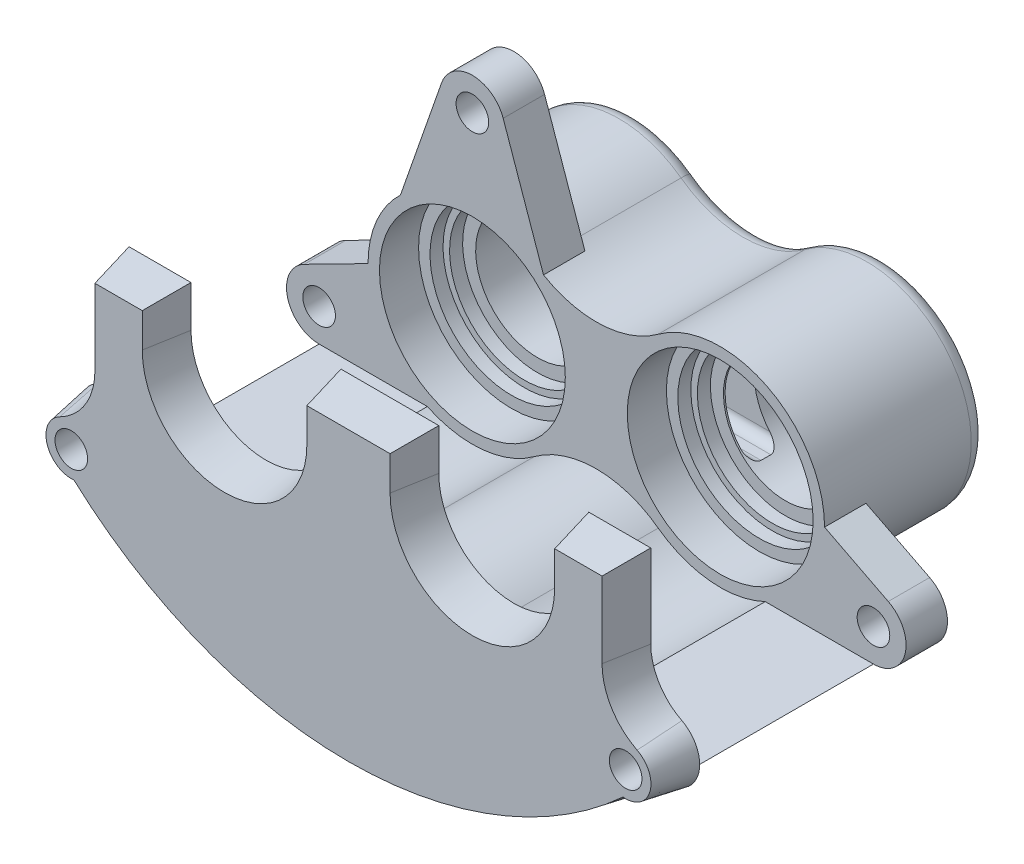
ISO-10303-21;
HEADER;
FILE_DESCRIPTION(('STEP AP214'),'2;1');
FILE_NAME('part.step','',(''),(''),'','','');
FILE_SCHEMA(('AUTOMOTIVE_DESIGN { 1 0 10303 214 1 1 1 1 }'));
ENDSEC;
DATA;
#1=APPLICATION_CONTEXT('core data for automotive mechanical design processes');
#2=APPLICATION_PROTOCOL_DEFINITION('international standard','automotive_design',2000,#1);
#3=PRODUCT_CONTEXT('',#1,'mechanical');
#4=PRODUCT('Part','Part','',(#3));
#5=PRODUCT_RELATED_PRODUCT_CATEGORY('part','',(#4));
#6=PRODUCT_DEFINITION_FORMATION('','',#4);
#7=PRODUCT_DEFINITION_CONTEXT('part definition',#1,'design');
#8=PRODUCT_DEFINITION('design','',#6,#7);
#9=PRODUCT_DEFINITION_SHAPE('','',#8);
#10=(LENGTH_UNIT() NAMED_UNIT(*) SI_UNIT(.MILLI.,.METRE.));
#11=(NAMED_UNIT(*) PLANE_ANGLE_UNIT() SI_UNIT($,.RADIAN.));
#12=(NAMED_UNIT(*) SI_UNIT($,.STERADIAN.) SOLID_ANGLE_UNIT());
#13=UNCERTAINTY_MEASURE_WITH_UNIT(LENGTH_MEASURE(1.E-05),#10,'distance_accuracy_value','');
#14=(GEOMETRIC_REPRESENTATION_CONTEXT(3) GLOBAL_UNCERTAINTY_ASSIGNED_CONTEXT((#13)) GLOBAL_UNIT_ASSIGNED_CONTEXT((#10,
#11,#12)) REPRESENTATION_CONTEXT('',''));
#15=CARTESIAN_POINT('',(0.,0.,0.));
#16=DIRECTION('',(0.,0.,1.));
#17=DIRECTION('',(1.,0.,0.));
#18=AXIS2_PLACEMENT_3D('',#15,#16,#17);
#19=CARTESIAN_POINT('',(19.,0.00121362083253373,12.5));
#20=DIRECTION('',(0.,0.,-1.));
#21=DIRECTION('',(-1.,0.,0.));
#22=AXIS2_PLACEMENT_3D('',#19,#20,#21);
#23=CYLINDRICAL_SURFACE('',#22,16.);
#24=DIRECTION('',(0.,0.,-1.));
#25=VECTOR('',#24,1.);
#26=CARTESIAN_POINT('',(9.5,-12.8731795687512,12.5));
#27=LINE('',#26,#25);
#28=CARTESIAN_POINT('',(9.5,-12.8731795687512,6.15));
#29=VERTEX_POINT('',#28);
#30=CARTESIAN_POINT('',(9.5,-12.8731795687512,-10.));
#31=VERTEX_POINT('',#30);
#32=EDGE_CURVE('E771',#29,#31,#27,.T.);
#33=ORIENTED_EDGE('',*,*,#32,.T.);
#34=CARTESIAN_POINT('',(19.,0.00121362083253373,-10.));
#35=DIRECTION('',(0.,0.,-1.));
#36=DIRECTION('',(-1.,0.,0.));
#37=AXIS2_PLACEMENT_3D('',#34,#35,#36);
#38=CIRCLE('',#37,16.);
#39=CARTESIAN_POINT('',(9.50000000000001,12.8756068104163,-10.));
#40=VERTEX_POINT('',#39);
#41=EDGE_CURVE('E11',#31,#40,#38,.F.);
#42=ORIENTED_EDGE('',*,*,#41,.T.);
#43=DIRECTION('',(0.,0.,-1.));
#44=VECTOR('',#43,1.);
#45=CARTESIAN_POINT('',(9.50000000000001,12.8756068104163,12.5));
#46=LINE('',#45,#44);
#47=CARTESIAN_POINT('',(9.50000000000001,12.8756068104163,12.5));
#48=VERTEX_POINT('',#47);
#49=EDGE_CURVE('E774',#48,#40,#46,.T.);
#50=ORIENTED_EDGE('',*,*,#49,.F.);
#51=CARTESIAN_POINT('',(19.,0.00121362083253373,12.5));
#52=DIRECTION('',(0.,0.,1.));
#53=DIRECTION('',(1.,0.,0.));
#54=AXIS2_PLACEMENT_3D('',#51,#52,#53);
#55=CIRCLE('',#54,16.);
#56=CARTESIAN_POINT('',(35.,0.00121362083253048,12.5));
#57=VERTEX_POINT('',#56);
#58=EDGE_CURVE('E781',#57,#48,#55,.T.);
#59=ORIENTED_EDGE('',*,*,#58,.F.);
#60=DIRECTION('',(0.,0.,1.));
#61=VECTOR('',#60,1.);
#62=CARTESIAN_POINT('',(35.,0.00121362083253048,6.15));
#63=LINE('',#62,#61);
#64=CARTESIAN_POINT('',(35.,0.00121362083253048,6.15));
#65=VERTEX_POINT('',#64);
#66=EDGE_CURVE('E479',#65,#57,#63,.T.);
#67=ORIENTED_EDGE('',*,*,#66,.F.);
#68=CARTESIAN_POINT('',(19.,0.00121362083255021,6.15));
#69=DIRECTION('',(0.,0.,1.));
#70=DIRECTION('',(-1.,0.,0.));
#71=AXIS2_PLACEMENT_3D('',#68,#69,#70);
#72=CIRCLE('',#71,16.);
#73=EDGE_CURVE('E460',#29,#65,#72,.T.);
#74=ORIENTED_EDGE('',*,*,#73,.F.);
#75=EDGE_LOOP('',(#33,#42,#50,#59,#67,#74));
#76=FACE_BOUND('',#75,.T.);
#77=ADVANCED_FACE('F39',(#76),#23,.T.);
#78=CARTESIAN_POINT('',(-19.,0.00121362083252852,12.5));
#79=DIRECTION('',(0.,0.,-1.));
#80=DIRECTION('',(-1.,0.,0.));
#81=AXIS2_PLACEMENT_3D('',#78,#79,#80);
#82=CYLINDRICAL_SURFACE('',#81,16.);
#83=DIRECTION('',(0.,0.,-1.));
#84=VECTOR('',#83,1.);
#85=CARTESIAN_POINT('',(-9.5,12.8756068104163,12.5));
#86=LINE('',#85,#84);
#87=CARTESIAN_POINT('',(-9.5,12.8756068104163,6.15));
#88=VERTEX_POINT('',#87);
#89=CARTESIAN_POINT('',(-9.5,12.8756068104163,-10.));
#90=VERTEX_POINT('',#89);
#91=EDGE_CURVE('E764',#88,#90,#86,.T.);
#92=ORIENTED_EDGE('',*,*,#91,.T.);
#93=CARTESIAN_POINT('',(-19.,0.00121362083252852,-10.));
#94=DIRECTION('',(0.,0.,-1.));
#95=DIRECTION('',(-1.,0.,0.));
#96=AXIS2_PLACEMENT_3D('',#93,#94,#95);
#97=CIRCLE('',#96,16.);
#98=CARTESIAN_POINT('',(-9.5,-12.8731795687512,-10.));
#99=VERTEX_POINT('',#98);
#100=EDGE_CURVE('E746',#90,#99,#97,.F.);
#101=ORIENTED_EDGE('',*,*,#100,.T.);
#102=DIRECTION('',(0.,0.,-1.));
#103=VECTOR('',#102,1.);
#104=CARTESIAN_POINT('',(-9.5,-12.8731795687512,12.5));
#105=LINE('',#104,#103);
#106=CARTESIAN_POINT('',(-9.49999999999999,-12.8731795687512,6.15));
#107=VERTEX_POINT('',#106);
#108=EDGE_CURVE('E767',#107,#99,#105,.T.);
#109=ORIENTED_EDGE('',*,*,#108,.F.);
#110=CARTESIAN_POINT('',(-19.,0.00121362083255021,6.15));
#111=DIRECTION('',(0.,0.,-1.));
#112=DIRECTION('',(1.,0.,0.));
#113=AXIS2_PLACEMENT_3D('',#110,#111,#112);
#114=CIRCLE('',#113,16.);
#115=CARTESIAN_POINT('',(-35.,0.00121362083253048,6.15));
#116=VERTEX_POINT('',#115);
#117=EDGE_CURVE('E489',#107,#116,#114,.T.);
#118=ORIENTED_EDGE('',*,*,#117,.T.);
#119=DIRECTION('',(0.,0.,1.));
#120=VECTOR('',#119,1.);
#121=CARTESIAN_POINT('',(-35.,0.00121362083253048,6.15));
#122=LINE('',#121,#120);
#123=CARTESIAN_POINT('',(-35.,0.00121362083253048,12.5));
#124=VERTEX_POINT('',#123);
#125=EDGE_CURVE('E502',#116,#124,#122,.T.);
#126=ORIENTED_EDGE('',*,*,#125,.T.);
#127=CARTESIAN_POINT('',(-19.,0.00121362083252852,12.5));
#128=DIRECTION('',(0.,0.,1.));
#129=DIRECTION('',(1.,0.,0.));
#130=AXIS2_PLACEMENT_3D('',#127,#128,#129);
#131=CIRCLE('',#130,16.);
#132=CARTESIAN_POINT('',(-30.0284665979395,11.5931472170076,12.5));
#133=VERTEX_POINT('',#132);
#134=EDGE_CURVE('E785',#133,#124,#131,.T.);
#135=ORIENTED_EDGE('',*,*,#134,.F.);
#136=DIRECTION('',(0.,0.,1.));
#137=VECTOR('',#136,1.);
#138=CARTESIAN_POINT('',(-30.0284665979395,11.5931472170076,6.15));
#139=LINE('',#138,#137);
#140=CARTESIAN_POINT('',(-30.0284665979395,11.5931472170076,6.15));
#141=VERTEX_POINT('',#140);
#142=EDGE_CURVE('E454',#141,#133,#139,.T.);
#143=ORIENTED_EDGE('',*,*,#142,.F.);
#144=CARTESIAN_POINT('',(-19.,0.00121362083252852,6.15));
#145=DIRECTION('',(0.,0.,-1.));
#146=DIRECTION('',(1.,0.,0.));
#147=AXIS2_PLACEMENT_3D('',#144,#145,#146);
#148=CIRCLE('',#147,16.);
#149=EDGE_CURVE('E424',#141,#88,#148,.T.);
#150=ORIENTED_EDGE('',*,*,#149,.T.);
#151=EDGE_LOOP('',(#92,#101,#109,#118,#126,#135,#143,#150));
#152=FACE_BOUND('',#151,.T.);
#153=ADVANCED_FACE('F684',(#152),#82,.T.);
#154=CARTESIAN_POINT('',(0.,-25.7475727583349,12.5));
#155=DIRECTION('',(0.,0.,-1.));
#156=DIRECTION('',(-1.,0.,0.));
#157=AXIS2_PLACEMENT_3D('',#154,#155,#156);
#158=CYLINDRICAL_SURFACE('',#157,16.);
#159=ORIENTED_EDGE('',*,*,#108,.T.);
#160=CARTESIAN_POINT('',(0.,-25.7475727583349,-10.));
#161=DIRECTION('',(0.,0.,-1.));
#162=DIRECTION('',(-1.,0.,0.));
#163=AXIS2_PLACEMENT_3D('',#160,#161,#162);
#164=CIRCLE('',#163,16.);
#165=EDGE_CURVE('E749',#99,#31,#164,.T.);
#166=ORIENTED_EDGE('',*,*,#165,.T.);
#167=ORIENTED_EDGE('',*,*,#32,.F.);
#168=CARTESIAN_POINT('',(0.,-25.7475727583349,6.15));
#169=DIRECTION('',(0.,0.,-1.));
#170=DIRECTION('',(-1.,0.,0.));
#171=AXIS2_PLACEMENT_3D('',#168,#169,#170);
#172=CIRCLE('',#171,16.);
#173=EDGE_CURVE('E360',#107,#29,#172,.T.);
#174=ORIENTED_EDGE('',*,*,#173,.F.);
#175=EDGE_LOOP('',(#159,#166,#167,#174));
#176=FACE_BOUND('',#175,.T.);
#177=ADVANCED_FACE('F689',(#176),#158,.F.);
#178=CARTESIAN_POINT('',(0.,25.75,12.5));
#179=DIRECTION('',(0.,0.,-1.));
#180=DIRECTION('',(-1.,0.,0.));
#181=AXIS2_PLACEMENT_3D('',#178,#179,#180);
#182=CYLINDRICAL_SURFACE('',#181,16.);
#183=ORIENTED_EDGE('',*,*,#49,.T.);
#184=CARTESIAN_POINT('',(0.,25.75,-10.));
#185=DIRECTION('',(0.,0.,-1.));
#186=DIRECTION('',(-1.,0.,0.));
#187=AXIS2_PLACEMENT_3D('',#184,#185,#186);
#188=CIRCLE('',#187,16.);
#189=EDGE_CURVE('E49',#40,#90,#188,.T.);
#190=ORIENTED_EDGE('',*,*,#189,.T.);
#191=ORIENTED_EDGE('',*,*,#91,.F.);
#192=CARTESIAN_POINT('',(0.,25.75,6.15));
#193=DIRECTION('',(0.,0.,1.));
#194=DIRECTION('',(1.,0.,0.));
#195=AXIS2_PLACEMENT_3D('',#192,#193,#194);
#196=CIRCLE('',#195,16.);
#197=CARTESIAN_POINT('',(-8.09595587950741,11.9494384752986,6.15));
#198=VERTEX_POINT('',#197);
#199=EDGE_CURVE('E428',#88,#198,#196,.T.);
#200=ORIENTED_EDGE('',*,*,#199,.T.);
#201=DIRECTION('',(0.,0.,1.));
#202=VECTOR('',#201,1.);
#203=CARTESIAN_POINT('',(-8.09595587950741,11.9494384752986,6.15));
#204=LINE('',#203,#202);
#205=CARTESIAN_POINT('',(-8.09595587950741,11.9494384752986,12.5));
#206=VERTEX_POINT('',#205);
#207=EDGE_CURVE('E450',#198,#206,#204,.T.);
#208=ORIENTED_EDGE('',*,*,#207,.T.);
#209=CARTESIAN_POINT('',(0.,25.75,12.5));
#210=DIRECTION('',(0.,0.,-1.));
#211=DIRECTION('',(-1.,0.,0.));
#212=AXIS2_PLACEMENT_3D('',#209,#210,#211);
#213=CIRCLE('',#212,16.);
#214=EDGE_CURVE('E789',#48,#206,#213,.T.);
#215=ORIENTED_EDGE('',*,*,#214,.F.);
#216=EDGE_LOOP('',(#183,#190,#191,#200,#208,#215));
#217=FACE_BOUND('',#216,.T.);
#218=ADVANCED_FACE('F697',(#217),#182,.F.);
#219=CARTESIAN_POINT('',(-9.5,12.8756068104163,12.5));
#220=DIRECTION('',(0.,0.,-1.));
#221=DIRECTION('',(-1.,0.,0.));
#222=AXIS2_PLACEMENT_3D('',#219,#220,#221);
#223=PLANE('',#222);
#224=CARTESIAN_POINT('',(-42.5,-9.43185843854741,12.5));
#225=DIRECTION('',(0.,0.,-1.));
#226=DIRECTION('',(-1.,0.,0.));
#227=AXIS2_PLACEMENT_3D('',#224,#225,#226);
#228=CIRCLE('',#227,2.5);
#229=CARTESIAN_POINT('',(-45.,-9.43185843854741,12.5));
#230=VERTEX_POINT('',#229);
#231=EDGE_CURVE('E1855',#230,#230,#228,.F.);
#232=ORIENTED_EDGE('',*,*,#231,.F.);
#233=EDGE_LOOP('',(#232));
#234=FACE_BOUND('',#233,.T.);
#235=CARTESIAN_POINT('',(42.5,-9.43185843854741,12.5));
#236=DIRECTION('',(0.,0.,-1.));
#237=DIRECTION('',(-1.,0.,0.));
#238=AXIS2_PLACEMENT_3D('',#235,#236,#237);
#239=CIRCLE('',#238,2.5);
#240=CARTESIAN_POINT('',(40.,-9.43185843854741,12.5));
#241=VERTEX_POINT('',#240);
#242=EDGE_CURVE('E334',#241,#241,#239,.T.);
#243=ORIENTED_EDGE('',*,*,#242,.T.);
#244=EDGE_LOOP('',(#243));
#245=FACE_BOUND('',#244,.T.);
#246=ORIENTED_EDGE('',*,*,#214,.T.);
#247=DIRECTION('',(-0.329690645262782,0.944089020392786,0.));
#248=VECTOR('',#247,1.);
#249=CARTESIAN_POINT('',(-14.2795548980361,29.6565467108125,12.5));
#250=LINE('',#249,#248);
#251=CARTESIAN_POINT('',(-14.2795548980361,29.6565467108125,12.5));
#252=VERTEX_POINT('',#251);
#253=EDGE_CURVE('E420',#206,#252,#250,.T.);
#254=ORIENTED_EDGE('',*,*,#253,.T.);
#255=CARTESIAN_POINT('',(-19.,28.0080934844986,12.5));
#256=DIRECTION('',(0.,0.,1.));
#257=DIRECTION('',(1.,0.,0.));
#258=AXIS2_PLACEMENT_3D('',#255,#256,#257);
#259=CIRCLE('',#258,5.);
#260=CARTESIAN_POINT('',(-23.7204451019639,29.6565467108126,12.5));
#261=VERTEX_POINT('',#260);
#262=EDGE_CURVE('E411',#252,#261,#259,.T.);
#263=ORIENTED_EDGE('',*,*,#262,.T.);
#264=DIRECTION('',(-0.329690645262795,-0.944089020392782,0.));
#265=VECTOR('',#264,1.);
#266=CARTESIAN_POINT('',(-23.7204451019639,29.6565467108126,12.5));
#267=LINE('',#266,#265);
#268=EDGE_CURVE('E440',#261,#133,#267,.T.);
#269=ORIENTED_EDGE('',*,*,#268,.T.);
#270=ORIENTED_EDGE('',*,*,#134,.T.);
#271=DIRECTION('',(-0.891006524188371,-0.453990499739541,0.));
#272=VECTOR('',#271,1.);
#273=CARTESIAN_POINT('',(-35.,0.00121362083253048,12.5));
#274=LINE('',#273,#272);
#275=CARTESIAN_POINT('',(-44.7699524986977,-4.97682581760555,12.5));
#276=VERTEX_POINT('',#275);
#277=EDGE_CURVE('E482',#124,#276,#274,.T.);
#278=ORIENTED_EDGE('',*,*,#277,.T.);
#279=CARTESIAN_POINT('',(-42.5,-9.43185843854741,12.5));
#280=DIRECTION('',(0.,0.,1.));
#281=DIRECTION('',(1.,0.,0.));
#282=AXIS2_PLACEMENT_3D('',#279,#280,#281);
#283=CIRCLE('',#282,5.);
#284=CARTESIAN_POINT('',(-42.5,-14.4318584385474,12.5));
#285=VERTEX_POINT('',#284);
#286=EDGE_CURVE('E506',#276,#285,#283,.T.);
#287=ORIENTED_EDGE('',*,*,#286,.T.);
#288=DIRECTION('',(1.,0.,0.));
#289=VECTOR('',#288,1.);
#290=CARTESIAN_POINT('',(-42.5,-14.4318584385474,12.5));
#291=LINE('',#290,#289);
#292=CARTESIAN_POINT('',(-25.9055362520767,-14.4318584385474,12.5));
#293=VERTEX_POINT('',#292);
#294=EDGE_CURVE('E494',#285,#293,#291,.T.);
#295=ORIENTED_EDGE('',*,*,#294,.T.);
#296=CARTESIAN_POINT('',(-9.49999999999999,-12.8731795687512,12.5));
#297=VERTEX_POINT('',#296);
#298=EDGE_CURVE('E788',#293,#297,#131,.T.);
#299=ORIENTED_EDGE('',*,*,#298,.T.);
#300=CARTESIAN_POINT('',(0.,-25.7475727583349,12.5));
#301=DIRECTION('',(0.,0.,1.));
#302=DIRECTION('',(1.,0.,0.));
#303=AXIS2_PLACEMENT_3D('',#300,#301,#302);
#304=CIRCLE('',#303,16.);
#305=CARTESIAN_POINT('',(9.5,-12.8731795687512,12.5));
#306=VERTEX_POINT('',#305);
#307=EDGE_CURVE('E782',#306,#297,#304,.T.);
#308=ORIENTED_EDGE('',*,*,#307,.F.);
#309=CARTESIAN_POINT('',(25.9055362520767,-14.4318584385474,12.5));
#310=VERTEX_POINT('',#309);
#311=EDGE_CURVE('E777',#306,#310,#55,.T.);
#312=ORIENTED_EDGE('',*,*,#311,.T.);
#313=DIRECTION('',(-1.,0.,0.));
#314=VECTOR('',#313,1.);
#315=CARTESIAN_POINT('',(42.5,-14.4318584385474,12.5));
#316=LINE('',#315,#314);
#317=CARTESIAN_POINT('',(42.5,-14.4318584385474,12.5));
#318=VERTEX_POINT('',#317);
#319=EDGE_CURVE('E449',#318,#310,#316,.T.);
#320=ORIENTED_EDGE('',*,*,#319,.F.);
#321=CARTESIAN_POINT('',(42.5,-9.43185843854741,12.5));
#322=DIRECTION('',(0.,0.,-1.));
#323=DIRECTION('',(-1.,0.,0.));
#324=AXIS2_PLACEMENT_3D('',#321,#322,#323);
#325=CIRCLE('',#324,5.);
#326=CARTESIAN_POINT('',(44.7699524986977,-4.97682581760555,12.5));
#327=VERTEX_POINT('',#326);
#328=EDGE_CURVE('E474',#327,#318,#325,.T.);
#329=ORIENTED_EDGE('',*,*,#328,.F.);
#330=DIRECTION('',(0.891006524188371,-0.453990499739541,0.));
#331=VECTOR('',#330,1.);
#332=CARTESIAN_POINT('',(35.,0.00121362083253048,12.5));
#333=LINE('',#332,#331);
#334=EDGE_CURVE('E465',#57,#327,#333,.T.);
#335=ORIENTED_EDGE('',*,*,#334,.F.);
#336=ORIENTED_EDGE('',*,*,#58,.T.);
#337=EDGE_LOOP('',(#246,#254,#263,#269,#270,#278,#287,#295,#299,#308,#312,#320,#329,#335,#336));
#338=FACE_BOUND('',#337,.T.);
#339=CARTESIAN_POINT('',(-19.,0.0012136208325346,12.5));
#340=DIRECTION('',(0.,0.,1.));
#341=DIRECTION('',(0.,1.,0.));
#342=AXIS2_PLACEMENT_3D('',#339,#340,#341);
#343=CIRCLE('',#342,14.25);
#344=CARTESIAN_POINT('',(-19.,14.2512136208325,12.5));
#345=VERTEX_POINT('',#344);
#346=EDGE_CURVE('E833',#345,#345,#343,.T.);
#347=ORIENTED_EDGE('',*,*,#346,.F.);
#348=EDGE_LOOP('',(#347));
#349=FACE_BOUND('',#348,.T.);
#350=CARTESIAN_POINT('',(19.,0.0012136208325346,12.5));
#351=DIRECTION('',(0.,0.,-1.));
#352=DIRECTION('',(0.,1.,0.));
#353=AXIS2_PLACEMENT_3D('',#350,#351,#352);
#354=CIRCLE('',#353,14.25);
#355=CARTESIAN_POINT('',(19.,14.2512136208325,12.5));
#356=VERTEX_POINT('',#355);
#357=EDGE_CURVE('E793',#356,#356,#354,.T.);
#358=ORIENTED_EDGE('',*,*,#357,.T.);
#359=EDGE_LOOP('',(#358));
#360=FACE_BOUND('',#359,.T.);
#361=CARTESIAN_POINT('',(-19.,28.0080934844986,12.5));
#362=DIRECTION('',(0.,0.,1.));
#363=DIRECTION('',(1.,0.,0.));
#364=AXIS2_PLACEMENT_3D('',#361,#362,#363);
#365=CIRCLE('',#364,2.5);
#366=CARTESIAN_POINT('',(-16.5,28.0080934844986,12.5));
#367=VERTEX_POINT('',#366);
#368=EDGE_CURVE('E370',#367,#367,#365,.T.);
#369=ORIENTED_EDGE('',*,*,#368,.F.);
#370=EDGE_LOOP('',(#369));
#371=FACE_BOUND('',#370,.T.);
#372=ADVANCED_FACE('F702',(#234,#245,#338,#349,#360,#371),#223,.F.);
#373=CARTESIAN_POINT('',(-9.5,12.8756068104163,-12.5));
#374=DIRECTION('',(0.,0.,-1.));
#375=DIRECTION('',(-1.,0.,0.));
#376=AXIS2_PLACEMENT_3D('',#373,#374,#375);
#377=PLANE('',#376);
#378=CARTESIAN_POINT('',(19.,0.00121362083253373,-12.5));
#379=DIRECTION('',(0.,0.,-1.));
#380=DIRECTION('',(-1.,0.,0.));
#381=AXIS2_PLACEMENT_3D('',#378,#379,#380);
#382=CIRCLE('',#381,13.5);
#383=CARTESIAN_POINT('',(10.984375,10.8639828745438,-12.5));
#384=VERTEX_POINT('',#383);
#385=CARTESIAN_POINT('',(10.984375,-10.8615556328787,-12.5));
#386=VERTEX_POINT('',#385);
#387=EDGE_CURVE('E723',#384,#386,#382,.T.);
#388=ORIENTED_EDGE('',*,*,#387,.T.);
#389=CARTESIAN_POINT('',(0.,-25.7475727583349,-12.5));
#390=DIRECTION('',(0.,0.,-1.));
#391=DIRECTION('',(-1.,0.,0.));
#392=AXIS2_PLACEMENT_3D('',#389,#390,#391);
#393=CIRCLE('',#392,18.5);
#394=CARTESIAN_POINT('',(-10.984375,-10.8615556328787,-12.5));
#395=VERTEX_POINT('',#394);
#396=EDGE_CURVE('E752',#386,#395,#393,.F.);
#397=ORIENTED_EDGE('',*,*,#396,.T.);
#398=CARTESIAN_POINT('',(-19.,0.00121362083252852,-12.5));
#399=DIRECTION('',(0.,0.,-1.));
#400=DIRECTION('',(-1.,0.,0.));
#401=AXIS2_PLACEMENT_3D('',#398,#399,#400);
#402=CIRCLE('',#401,13.5);
#403=CARTESIAN_POINT('',(-10.984375,10.8639828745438,-12.5));
#404=VERTEX_POINT('',#403);
#405=EDGE_CURVE('E756',#395,#404,#402,.T.);
#406=ORIENTED_EDGE('',*,*,#405,.T.);
#407=CARTESIAN_POINT('',(0.,25.75,-12.5));
#408=DIRECTION('',(0.,0.,-1.));
#409=DIRECTION('',(-1.,0.,0.));
#410=AXIS2_PLACEMENT_3D('',#407,#408,#409);
#411=CIRCLE('',#410,18.5);
#412=EDGE_CURVE('E759',#404,#384,#411,.F.);
#413=ORIENTED_EDGE('',*,*,#412,.T.);
#414=EDGE_LOOP('',(#388,#397,#406,#413));
#415=FACE_BOUND('',#414,.T.);
#416=ADVANCED_FACE('F694',(#415),#377,.T.);
#417=CARTESIAN_POINT('',(19.,0.0012136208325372,-8.5));
#418=DIRECTION('',(0.,0.,-1.));
#419=DIRECTION('',(0.,1.,0.));
#420=AXIS2_PLACEMENT_3D('',#417,#418,#419);
#421=CYLINDRICAL_SURFACE('',#420,14.25);
#422=ORIENTED_EDGE('',*,*,#357,.F.);
#423=EDGE_LOOP('',(#422));
#424=FACE_BOUND('',#423,.T.);
#425=CARTESIAN_POINT('',(19.,0.00121362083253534,6.5));
#426=DIRECTION('',(0.,0.,-1.));
#427=DIRECTION('',(0.,1.,0.));
#428=AXIS2_PLACEMENT_3D('',#425,#426,#427);
#429=CIRCLE('',#428,14.25);
#430=CARTESIAN_POINT('',(19.,14.2512136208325,6.5));
#431=VERTEX_POINT('',#430);
#432=EDGE_CURVE('E797',#431,#431,#429,.T.);
#433=ORIENTED_EDGE('',*,*,#432,.T.);
#434=EDGE_LOOP('',(#433));
#435=FACE_BOUND('',#434,.T.);
#436=ADVANCED_FACE('F1344',(#424,#435),#421,.F.);
#437=CARTESIAN_POINT('',(19.,14.2512136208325,6.5));
#438=DIRECTION('',(0.,0.,-1.));
#439=DIRECTION('',(0.,1.,0.));
#440=AXIS2_PLACEMENT_3D('',#437,#438,#439);
#441=PLANE('',#440);
#442=ORIENTED_EDGE('',*,*,#432,.F.);
#443=EDGE_LOOP('',(#442));
#444=FACE_BOUND('',#443,.T.);
#445=CARTESIAN_POINT('',(19.,0.00121362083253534,6.5));
#446=DIRECTION('',(0.,0.,-1.));
#447=DIRECTION('',(0.,1.,0.));
#448=AXIS2_PLACEMENT_3D('',#445,#446,#447);
#449=CIRCLE('',#448,12.5);
#450=CARTESIAN_POINT('',(19.,12.5012136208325,6.5));
#451=VERTEX_POINT('',#450);
#452=EDGE_CURVE('E801',#451,#451,#449,.T.);
#453=ORIENTED_EDGE('',*,*,#452,.T.);
#454=EDGE_LOOP('',(#453));
#455=FACE_BOUND('',#454,.T.);
#456=ADVANCED_FACE('F1374',(#444,#455),#441,.F.);
#457=CARTESIAN_POINT('',(19.,0.0012136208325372,-8.5));
#458=DIRECTION('',(0.,0.,-1.));
#459=DIRECTION('',(0.,1.,0.));
#460=AXIS2_PLACEMENT_3D('',#457,#458,#459);
#461=CYLINDRICAL_SURFACE('',#460,12.5);
#462=ORIENTED_EDGE('',*,*,#452,.F.);
#463=EDGE_LOOP('',(#462));
#464=FACE_BOUND('',#463,.T.);
#465=CARTESIAN_POINT('',(19.,0.00121362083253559,4.5));
#466=DIRECTION('',(0.,0.,-1.));
#467=DIRECTION('',(0.,1.,0.));
#468=AXIS2_PLACEMENT_3D('',#465,#466,#467);
#469=CIRCLE('',#468,12.5);
#470=CARTESIAN_POINT('',(19.,12.5012136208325,4.5));
#471=VERTEX_POINT('',#470);
#472=EDGE_CURVE('E805',#471,#471,#469,.T.);
#473=ORIENTED_EDGE('',*,*,#472,.T.);
#474=EDGE_LOOP('',(#473));
#475=FACE_BOUND('',#474,.T.);
#476=ADVANCED_FACE('F1381',(#464,#475),#461,.F.);
#477=CARTESIAN_POINT('',(19.,12.5012136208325,4.5));
#478=DIRECTION('',(0.,0.,-1.));
#479=DIRECTION('',(0.,1.,0.));
#480=AXIS2_PLACEMENT_3D('',#477,#478,#479);
#481=PLANE('',#480);
#482=ORIENTED_EDGE('',*,*,#472,.F.);
#483=EDGE_LOOP('',(#482));
#484=FACE_BOUND('',#483,.T.);
#485=CARTESIAN_POINT('',(19.,0.00121362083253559,4.5));
#486=DIRECTION('',(0.,0.,-1.));
#487=DIRECTION('',(0.,1.,0.));
#488=AXIS2_PLACEMENT_3D('',#485,#486,#487);
#489=CIRCLE('',#488,11.5);
#490=CARTESIAN_POINT('',(19.,11.5012136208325,4.5));
#491=VERTEX_POINT('',#490);
#492=EDGE_CURVE('E809',#491,#491,#489,.T.);
#493=ORIENTED_EDGE('',*,*,#492,.T.);
#494=EDGE_LOOP('',(#493));
#495=FACE_BOUND('',#494,.T.);
#496=ADVANCED_FACE('F1389',(#484,#495),#481,.F.);
#497=CARTESIAN_POINT('',(19.,0.0012136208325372,-8.5));
#498=DIRECTION('',(0.,0.,-1.));
#499=DIRECTION('',(0.,1.,0.));
#500=AXIS2_PLACEMENT_3D('',#497,#498,#499);
#501=CYLINDRICAL_SURFACE('',#500,11.5);
#502=ORIENTED_EDGE('',*,*,#492,.F.);
#503=EDGE_LOOP('',(#502));
#504=FACE_BOUND('',#503,.T.);
#505=CARTESIAN_POINT('',(19.,0.00121362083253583,2.5));
#506=DIRECTION('',(0.,0.,-1.));
#507=DIRECTION('',(0.,1.,0.));
#508=AXIS2_PLACEMENT_3D('',#505,#506,#507);
#509=CIRCLE('',#508,11.5);
#510=CARTESIAN_POINT('',(19.,11.5012136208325,2.50000000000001));
#511=VERTEX_POINT('',#510);
#512=EDGE_CURVE('E813',#511,#511,#509,.T.);
#513=ORIENTED_EDGE('',*,*,#512,.T.);
#514=EDGE_LOOP('',(#513));
#515=FACE_BOUND('',#514,.T.);
#516=ADVANCED_FACE('F1397',(#504,#515),#501,.F.);
#517=CARTESIAN_POINT('',(19.,11.5012136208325,2.50000000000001));
#518=DIRECTION('',(0.,0.,-1.));
#519=DIRECTION('',(0.,1.,0.));
#520=AXIS2_PLACEMENT_3D('',#517,#518,#519);
#521=PLANE('',#520);
#522=ORIENTED_EDGE('',*,*,#512,.F.);
#523=EDGE_LOOP('',(#522));
#524=FACE_BOUND('',#523,.T.);
#525=CARTESIAN_POINT('',(19.,0.00121362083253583,2.5));
#526=DIRECTION('',(0.,0.,-1.));
#527=DIRECTION('',(0.,1.,0.));
#528=AXIS2_PLACEMENT_3D('',#525,#526,#527);
#529=CIRCLE('',#528,9.5);
#530=CARTESIAN_POINT('',(19.,9.50121362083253,2.5));
#531=VERTEX_POINT('',#530);
#532=EDGE_CURVE('E817',#531,#531,#529,.T.);
#533=ORIENTED_EDGE('',*,*,#532,.T.);
#534=EDGE_LOOP('',(#533));
#535=FACE_BOUND('',#534,.T.);
#536=ADVANCED_FACE('F1405',(#524,#535),#521,.F.);
#537=CARTESIAN_POINT('',(19.,0.0012136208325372,-8.5));
#538=DIRECTION('',(0.,0.,-1.));
#539=DIRECTION('',(0.,1.,0.));
#540=AXIS2_PLACEMENT_3D('',#537,#538,#539);
#541=CYLINDRICAL_SURFACE('',#540,9.5);
#542=DIRECTION('',(0.,0.,-1.));
#543=VECTOR('',#542,1.);
#544=CARTESIAN_POINT('',(13.5039732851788,7.75,-8.5));
#545=LINE('',#544,#543);
#546=CARTESIAN_POINT('',(13.5039732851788,7.75,0.749999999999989));
#547=VERTEX_POINT('',#546);
#548=CARTESIAN_POINT('',(13.5039732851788,7.75,-0.74999999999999));
#549=VERTEX_POINT('',#548);
#550=EDGE_CURVE('E567',#547,#549,#545,.T.);
#551=ORIENTED_EDGE('',*,*,#550,.T.);
#552=CARTESIAN_POINT('',(13.5039732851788,7.75,-0.74999999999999));
#553=CARTESIAN_POINT('',(13.5039797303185,7.75000366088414,-0.776202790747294));
#554=CARTESIAN_POINT('',(13.503004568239,7.7493129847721,-0.802391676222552));
#555=CARTESIAN_POINT('',(13.4991539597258,7.7465800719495,-0.854531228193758));
#556=CARTESIAN_POINT('',(13.4962805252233,7.74453926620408,-0.880482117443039));
#557=CARTESIAN_POINT('',(13.4849879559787,7.73650482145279,-0.957174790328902));
#558=CARTESIAN_POINT('',(13.4738935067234,7.72859730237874,-1.00734528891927));
#559=CARTESIAN_POINT('',(13.4421176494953,7.70578398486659,-1.1167998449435));
#560=CARTESIAN_POINT('',(13.4197585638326,7.6896421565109,-1.17532441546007));
#561=CARTESIAN_POINT('',(13.3678717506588,7.65171484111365,-1.28732327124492));
#562=CARTESIAN_POINT('',(13.3383118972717,7.62990403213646,-1.34077338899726));
#563=CARTESIAN_POINT('',(13.257819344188,7.56963378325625,-1.46816503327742));
#564=CARTESIAN_POINT('',(13.2036623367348,7.52834845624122,-1.53870406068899));
#565=CARTESIAN_POINT('',(13.0886669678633,7.43838455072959,-1.66869991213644));
#566=CARTESIAN_POINT('',(13.0278143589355,7.38969011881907,-1.72813234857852));
#567=CARTESIAN_POINT('',(12.9178058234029,7.2992044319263,-1.8234744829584));
#568=CARTESIAN_POINT('',(12.8694716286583,7.2586772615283,-1.86156893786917));
#569=CARTESIAN_POINT('',(12.7714003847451,7.17468742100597,-1.93235804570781));
#570=CARTESIAN_POINT('',(12.7216626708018,7.13122334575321,-1.96505008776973));
#571=CARTESIAN_POINT('',(12.5712849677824,6.99689878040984,-2.05529609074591));
#572=CARTESIAN_POINT('',(12.4694193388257,6.90205624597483,-2.10507089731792));
#573=CARTESIAN_POINT('',(12.2788942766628,6.71628504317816,-2.17872131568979));
#574=CARTESIAN_POINT('',(12.1901880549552,6.6263689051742,-2.20506997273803));
#575=CARTESIAN_POINT('',(12.0588687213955,6.48771824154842,-2.23178774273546));
#576=CARTESIAN_POINT('',(12.0154434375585,6.44093805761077,-2.23855891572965));
#577=CARTESIAN_POINT('',(11.9293186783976,6.34625699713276,-2.24766260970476));
#578=CARTESIAN_POINT('',(11.8866195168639,6.29835565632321,-2.24999325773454));
#579=CARTESIAN_POINT('',(11.8443959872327,6.24999999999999,-2.25));
#580=B_SPLINE_CURVE_WITH_KNOTS('',3,(#552,#553,#554,#555,#556,#557,#558,#559,#560,#561,#562,
#563,#564,#565,#566,#567,#568,#569,#570,#571,#572,#573,#574,#575,#576,#577,#578,#579),
.UNSPECIFIED.,.F.,.F.,(4,2,2,2,2,2,2,2,2,2,2,2,2,4),(0.,0.0785554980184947,0.157027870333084,
0.312231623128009,0.505267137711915,0.69918017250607,0.991707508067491,1.28486980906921,
1.5056488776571,1.72653433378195,2.16802713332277,2.55389278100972,2.74630344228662,
2.93879524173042),.UNSPECIFIED.);
#581=CARTESIAN_POINT('',(11.8443959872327,6.24999999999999,-2.25));
#582=VERTEX_POINT('',#581);
#583=EDGE_CURVE('E559',#549,#582,#580,.T.);
#584=ORIENTED_EDGE('',*,*,#583,.T.);
#585=CARTESIAN_POINT('',(19.,0.00121362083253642,-2.25));
#586=DIRECTION('',(0.,0.,1.));
#587=DIRECTION('',(1.,0.,0.));
#588=AXIS2_PLACEMENT_3D('',#585,#586,#587);
#589=CIRCLE('',#588,9.5);
#590=CARTESIAN_POINT('',(11.8465163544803,-6.24999999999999,-2.25));
#591=VERTEX_POINT('',#590);
#592=EDGE_CURVE('E539',#582,#591,#589,.T.);
#593=ORIENTED_EDGE('',*,*,#592,.T.);
#594=CARTESIAN_POINT('',(11.8465163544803,-6.24999999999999,-2.25));
#595=CARTESIAN_POINT('',(11.8881101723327,-6.29760002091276,-2.24999252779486));
#596=CARTESIAN_POINT('',(11.9301567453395,-6.34475291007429,-2.24773493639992));
#597=CARTESIAN_POINT('',(12.0149565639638,-6.43797374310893,-2.23891295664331));
#598=CARTESIAN_POINT('',(12.0577094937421,-6.48404215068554,-2.23235044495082));
#599=CARTESIAN_POINT('',(12.1871861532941,-6.62082050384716,-2.20641197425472));
#600=CARTESIAN_POINT('',(12.2747366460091,-6.70965659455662,-2.18078855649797));
#601=CARTESIAN_POINT('',(12.4155661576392,-6.84720196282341,-2.12712042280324));
#602=CARTESIAN_POINT('',(12.4687986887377,-6.89796637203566,-2.10398027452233));
#603=CARTESIAN_POINT('',(12.574908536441,-6.99688948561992,-2.05202746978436));
#604=CARTESIAN_POINT('',(12.6277859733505,-7.04504911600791,-2.02321684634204));
#605=CARTESIAN_POINT('',(12.7325808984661,-7.13842066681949,-1.9599121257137));
#606=CARTESIAN_POINT('',(12.7844996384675,-7.18363665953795,-1.92542612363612));
#607=CARTESIAN_POINT('',(12.8867342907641,-7.27082121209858,-1.8505559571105));
#608=CARTESIAN_POINT('',(12.9370512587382,-7.31279193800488,-1.81017577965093));
#609=CARTESIAN_POINT('',(13.0409122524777,-7.39772381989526,-1.71804240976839));
#610=CARTESIAN_POINT('',(13.0941479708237,-7.44022933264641,-1.6655120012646));
#611=CARTESIAN_POINT('',(13.1955312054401,-7.51957541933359,-1.55185825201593));
#612=CARTESIAN_POINT('',(13.2436828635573,-7.55642061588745,-1.49074200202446));
#613=CARTESIAN_POINT('',(13.3212905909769,-7.61482448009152,-1.37482021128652));
#614=CARTESIAN_POINT('',(13.3524694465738,-7.63793467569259,-1.32197060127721));
#615=CARTESIAN_POINT('',(13.4079215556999,-7.67861943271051,-1.21099748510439));
#616=CARTESIAN_POINT('',(13.4322250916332,-7.6962183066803,-1.15289864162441));
#617=CARTESIAN_POINT('',(13.4695073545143,-7.72304246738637,-1.03845127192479));
#618=CARTESIAN_POINT('',(13.4834225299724,-7.73296445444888,-0.982585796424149));
#619=CARTESIAN_POINT('',(13.4976501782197,-7.74308617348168,-0.896774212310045));
#620=CARTESIAN_POINT('',(13.5012867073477,-7.74566744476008,-0.867629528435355));
#621=CARTESIAN_POINT('',(13.5061670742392,-7.74912853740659,-0.80899730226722));
#622=CARTESIAN_POINT('',(13.5074072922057,-7.75000578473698,-0.77950930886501));
#623=CARTESIAN_POINT('',(13.5073970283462,-7.75,-0.749999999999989));
#624=B_SPLINE_CURVE_WITH_KNOTS('',3,(#594,#595,#596,#597,#598,#599,#600,#601,#602,#603,#604,
#605,#606,#607,#608,#609,#610,#611,#612,#613,#614,#615,#616,#617,#618,#619,#620,#621,#622,#623),
.UNSPECIFIED.,.F.,.F.,(4,2,2,2,2,2,2,2,2,2,2,2,2,2,4),(0.,0.189524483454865,0.378966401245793,
0.759617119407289,0.990748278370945,1.22179672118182,1.45251841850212,1.6830847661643,
1.94054856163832,2.19780096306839,2.39387236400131,2.5890662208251,2.76328028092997,
2.85159710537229,2.94004723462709),.UNSPECIFIED.);
#625=CARTESIAN_POINT('',(13.5073970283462,-7.75,-0.74999999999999));
#626=VERTEX_POINT('',#625);
#627=EDGE_CURVE('E528',#591,#626,#624,.T.);
#628=ORIENTED_EDGE('',*,*,#627,.T.);
#629=DIRECTION('',(0.,0.,-1.));
#630=VECTOR('',#629,1.);
#631=CARTESIAN_POINT('',(13.5073970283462,-7.75,-8.5));
#632=LINE('',#631,#630);
#633=CARTESIAN_POINT('',(13.5073970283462,-7.75,0.749999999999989));
#634=VERTEX_POINT('',#633);
#635=EDGE_CURVE('E517',#626,#634,#632,.F.);
#636=ORIENTED_EDGE('',*,*,#635,.T.);
#637=CARTESIAN_POINT('',(13.5073970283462,-7.75,0.749999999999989));
#638=CARTESIAN_POINT('',(13.5074034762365,-7.75000365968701,0.776188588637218));
#639=CARTESIAN_POINT('',(13.506428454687,-7.74931372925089,0.802363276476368));
#640=CARTESIAN_POINT('',(13.5025784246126,-7.74658378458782,0.854474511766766));
#641=CARTESIAN_POINT('',(13.4997054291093,-7.74454520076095,0.880411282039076));
#642=CARTESIAN_POINT('',(13.4884146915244,-7.73651958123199,0.957061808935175));
#643=CARTESIAN_POINT('',(13.4773221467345,-7.72862082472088,1.0072045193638));
#644=CARTESIAN_POINT('',(13.4455502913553,-7.70583177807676,1.11660523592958));
#645=CARTESIAN_POINT('',(13.4231926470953,-7.68970613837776,1.17510366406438));
#646=CARTESIAN_POINT('',(13.3713096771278,-7.65181728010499,1.28705267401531));
#647=CARTESIAN_POINT('',(13.3417522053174,-7.63002874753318,1.3404790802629));
#648=CARTESIAN_POINT('',(13.261250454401,-7.56980846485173,1.46784199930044));
#649=CARTESIAN_POINT('',(13.2070786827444,-7.52855070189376,1.5383740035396));
#650=CARTESIAN_POINT('',(13.0920523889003,-7.43864685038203,1.66835863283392));
#651=CARTESIAN_POINT('',(13.0311836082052,-7.38998490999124,1.72778686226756));
#652=CARTESIAN_POINT('',(12.9211193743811,-7.29953768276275,1.82314935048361));
#653=CARTESIAN_POINT('',(12.8727446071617,-7.25901377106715,1.86126399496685));
#654=CARTESIAN_POINT('',(12.7745905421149,-7.17502916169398,1.93209117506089));
#655=CARTESIAN_POINT('',(12.7248105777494,-7.13156705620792,1.96480109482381));
#656=CARTESIAN_POINT('',(12.5743044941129,-6.9972463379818,2.05509859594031));
#657=CARTESIAN_POINT('',(12.4723513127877,-6.9024038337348,2.10490469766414));
#658=CARTESIAN_POINT('',(12.2816153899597,-6.71658248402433,2.17862807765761));
#659=CARTESIAN_POINT('',(12.1927861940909,-6.62661358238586,2.20501064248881));
#660=CARTESIAN_POINT('',(12.0612850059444,-6.48787628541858,2.23176333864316));
#661=CARTESIAN_POINT('',(12.0177997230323,-6.44106614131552,2.23854349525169));
#662=CARTESIAN_POINT('',(11.93155606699,-6.3463227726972,2.24765937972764));
#663=CARTESIAN_POINT('',(11.8887980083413,-6.29838908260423,2.24999323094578));
#664=CARTESIAN_POINT('',(11.8465163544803,-6.25,2.25));
#665=B_SPLINE_CURVE_WITH_KNOTS('',3,(#637,#638,#639,#640,#641,#642,#643,#644,#645,#646,#647,
#648,#649,#650,#651,#652,#653,#654,#655,#656,#657,#658,#659,#660,#661,#662,#663,#664),
.UNSPECIFIED.,.F.,.F.,(4,2,2,2,2,2,2,2,2,2,2,2,2,4),(0.,0.078512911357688,0.156942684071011,
0.312061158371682,0.50501250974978,0.698841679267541,0.991343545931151,1.2844806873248,
1.50536532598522,1.7263565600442,2.16806195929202,2.55431030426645,2.74691085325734,
2.93959267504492),.UNSPECIFIED.);
#666=CARTESIAN_POINT('',(11.8465163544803,-6.25,2.25));
#667=VERTEX_POINT('',#666);
#668=EDGE_CURVE('E527',#634,#667,#665,.T.);
#669=ORIENTED_EDGE('',*,*,#668,.T.);
#670=CARTESIAN_POINT('',(19.,0.00121362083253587,2.25));
#671=DIRECTION('',(0.,0.,-1.));
#672=DIRECTION('',(-1.,0.,0.));
#673=AXIS2_PLACEMENT_3D('',#670,#671,#672);
#674=CIRCLE('',#673,9.5);
#675=CARTESIAN_POINT('',(11.8443959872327,6.24999999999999,2.25));
#676=VERTEX_POINT('',#675);
#677=EDGE_CURVE('E580',#667,#676,#674,.T.);
#678=ORIENTED_EDGE('',*,*,#677,.T.);
#679=CARTESIAN_POINT('',(11.8443959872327,6.24999999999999,2.25));
#680=CARTESIAN_POINT('',(11.8859743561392,6.2976149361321,2.24999252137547));
#681=CARTESIAN_POINT('',(11.9280056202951,6.34478284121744,2.24773351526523));
#682=CARTESIAN_POINT('',(12.0127749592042,6.43803364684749,2.23890587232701));
#683=CARTESIAN_POINT('',(12.0555127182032,6.48411701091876,2.23233911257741));
#684=CARTESIAN_POINT('',(12.1849435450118,6.62093974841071,2.20638359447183));
#685=CARTESIAN_POINT('',(12.2724633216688,6.70980478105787,2.18074307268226));
#686=CARTESIAN_POINT('',(12.4132082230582,6.84736085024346,2.12705092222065));
#687=CARTESIAN_POINT('',(12.4663876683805,6.89810987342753,2.10391102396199));
#688=CARTESIAN_POINT('',(12.5723905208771,6.99700354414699,2.05196144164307));
#689=CARTESIAN_POINT('',(12.6252140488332,7.04514911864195,2.02315379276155));
#690=CARTESIAN_POINT('',(12.7299007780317,7.13849383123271,1.95985776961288));
#691=CARTESIAN_POINT('',(12.7817652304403,7.1836970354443,1.92537747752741));
#692=CARTESIAN_POINT('',(12.8838912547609,7.27085704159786,1.85052198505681));
#693=CARTESIAN_POINT('',(12.9341538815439,7.31281600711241,1.81015076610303));
#694=CARTESIAN_POINT('',(13.0379369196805,7.39775367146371,1.71800879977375));
#695=CARTESIAN_POINT('',(13.0911470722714,7.44027381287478,1.66545618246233));
#696=CARTESIAN_POINT('',(13.1924743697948,7.51964230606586,1.551754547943));
#697=CARTESIAN_POINT('',(13.2405956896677,7.55649531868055,1.49061267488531));
#698=CARTESIAN_POINT('',(13.3181409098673,7.61490209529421,1.37465170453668));
#699=CARTESIAN_POINT('',(13.3492893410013,7.63800975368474,1.32178932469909));
#700=CARTESIAN_POINT('',(13.4046804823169,7.67868551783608,1.21079377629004));
#701=CARTESIAN_POINT('',(13.4289534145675,7.696277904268,1.15268520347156));
#702=CARTESIAN_POINT('',(13.4661700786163,7.72307905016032,1.03825878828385));
#703=CARTESIAN_POINT('',(13.4800544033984,7.73298816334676,0.982425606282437));
#704=CARTESIAN_POINT('',(13.4942495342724,7.74309611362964,0.896669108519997));
#705=CARTESIAN_POINT('',(13.4978775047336,7.74567371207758,0.867544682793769));
#706=CARTESIAN_POINT('',(13.502746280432,7.74912981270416,0.808954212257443));
#707=CARTESIAN_POINT('',(13.5039834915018,7.7500057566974,0.779487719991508));
#708=CARTESIAN_POINT('',(13.5039732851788,7.75,0.749999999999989));
#709=B_SPLINE_CURVE_WITH_KNOTS('',3,(#679,#680,#681,#682,#683,#684,#685,#686,#687,#688,#689,
#690,#691,#692,#693,#694,#695,#696,#697,#698,#699,#700,#701,#702,#703,#704,#705,#706,#707,#708),
.UNSPECIFIED.,.F.,.F.,(4,2,2,2,2,2,2,2,2,2,2,2,2,2,4),(0.,0.189527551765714,0.378972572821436,
0.759628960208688,0.990619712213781,1.22152767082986,1.45210944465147,1.68253609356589,
1.94001388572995,2.19727877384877,2.39333474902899,2.58851506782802,2.7626108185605,
2.85086389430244,2.93924954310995),.UNSPECIFIED.);
#710=EDGE_CURVE('E573',#676,#547,#709,.T.);
#711=ORIENTED_EDGE('',*,*,#710,.T.);
#712=EDGE_LOOP('',(#551,#584,#593,#628,#636,#669,#678,#711));
#713=FACE_BOUND('',#712,.T.);
#714=ORIENTED_EDGE('',*,*,#532,.F.);
#715=EDGE_LOOP('',(#714));
#716=FACE_BOUND('',#715,.T.);
#717=CARTESIAN_POINT('',(19.,0.00121362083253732,-9.5));
#718=DIRECTION('',(0.,0.,-1.));
#719=DIRECTION('',(0.,1.,0.));
#720=AXIS2_PLACEMENT_3D('',#717,#718,#719);
#721=CIRCLE('',#720,9.5);
#722=CARTESIAN_POINT('',(19.,9.50121362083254,-9.49999999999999));
#723=VERTEX_POINT('',#722);
#724=EDGE_CURVE('E821',#723,#723,#721,.T.);
#725=ORIENTED_EDGE('',*,*,#724,.T.);
#726=EDGE_LOOP('',(#725));
#727=FACE_BOUND('',#726,.T.);
#728=ADVANCED_FACE('F589',(#713,#716,#727),#541,.F.);
#729=CARTESIAN_POINT('',(19.,9.50121362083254,-9.49999999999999));
#730=DIRECTION('',(0.,0.,-1.));
#731=DIRECTION('',(0.,1.,0.));
#732=AXIS2_PLACEMENT_3D('',#729,#730,#731);
#733=PLANE('',#732);
#734=ORIENTED_EDGE('',*,*,#724,.F.);
#735=EDGE_LOOP('',(#734));
#736=FACE_BOUND('',#735,.T.);
#737=CARTESIAN_POINT('',(19.,0.00121362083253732,-9.49999999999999));
#738=DIRECTION('',(0.,0.,-1.));
#739=DIRECTION('',(0.,1.,0.));
#740=AXIS2_PLACEMENT_3D('',#737,#738,#739);
#741=CIRCLE('',#740,4.5);
#742=CARTESIAN_POINT('',(19.,4.50121362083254,-9.49999999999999));
#743=VERTEX_POINT('',#742);
#744=EDGE_CURVE('E825',#743,#743,#741,.T.);
#745=ORIENTED_EDGE('',*,*,#744,.T.);
#746=EDGE_LOOP('',(#745));
#747=FACE_BOUND('',#746,.T.);
#748=ADVANCED_FACE('F1421',(#736,#747),#733,.F.);
#749=CARTESIAN_POINT('',(19.,0.0012136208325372,-8.5));
#750=DIRECTION('',(0.,0.,-1.));
#751=DIRECTION('',(0.,1.,0.));
#752=AXIS2_PLACEMENT_3D('',#749,#750,#751);
#753=CYLINDRICAL_SURFACE('',#752,4.5);
#754=ORIENTED_EDGE('',*,*,#744,.F.);
#755=EDGE_LOOP('',(#754));
#756=FACE_BOUND('',#755,.T.);
#757=CARTESIAN_POINT('',(19.,0.0012136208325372,-8.5));
#758=DIRECTION('',(0.,0.,-1.));
#759=DIRECTION('',(0.,1.,0.));
#760=AXIS2_PLACEMENT_3D('',#757,#758,#759);
#761=CIRCLE('',#760,4.5);
#762=CARTESIAN_POINT('',(19.,4.50121362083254,-8.5));
#763=VERTEX_POINT('',#762);
#764=EDGE_CURVE('E829',#763,#763,#761,.T.);
#765=ORIENTED_EDGE('',*,*,#764,.T.);
#766=EDGE_LOOP('',(#765));
#767=FACE_BOUND('',#766,.T.);
#768=ADVANCED_FACE('F1429',(#756,#767),#753,.T.);
#769=CARTESIAN_POINT('',(19.,4.50121362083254,-8.5));
#770=DIRECTION('',(0.,0.,-1.));
#771=DIRECTION('',(0.,1.,0.));
#772=AXIS2_PLACEMENT_3D('',#769,#770,#771);
#773=PLANE('',#772);
#774=ORIENTED_EDGE('',*,*,#764,.F.);
#775=EDGE_LOOP('',(#774));
#776=FACE_BOUND('',#775,.T.);
#777=ADVANCED_FACE('F1437',(#776),#773,.F.);
#778=CARTESIAN_POINT('',(-19.,0.0012136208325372,-8.5));
#779=DIRECTION('',(0.,0.,-1.));
#780=DIRECTION('',(0.,1.,0.));
#781=AXIS2_PLACEMENT_3D('',#778,#779,#780);
#782=CYLINDRICAL_SURFACE('',#781,14.25);
#783=ORIENTED_EDGE('',*,*,#346,.T.);
#784=EDGE_LOOP('',(#783));
#785=FACE_BOUND('',#784,.T.);
#786=CARTESIAN_POINT('',(-19.,0.00121362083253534,6.5));
#787=DIRECTION('',(0.,0.,1.));
#788=DIRECTION('',(0.,1.,0.));
#789=AXIS2_PLACEMENT_3D('',#786,#787,#788);
#790=CIRCLE('',#789,14.25);
#791=CARTESIAN_POINT('',(-19.,14.2512136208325,6.5));
#792=VERTEX_POINT('',#791);
#793=EDGE_CURVE('E837',#792,#792,#790,.T.);
#794=ORIENTED_EDGE('',*,*,#793,.F.);
#795=EDGE_LOOP('',(#794));
#796=FACE_BOUND('',#795,.T.);
#797=ADVANCED_FACE('F1445',(#785,#796),#782,.F.);
#798=CARTESIAN_POINT('',(-19.,14.2512136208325,6.5));
#799=DIRECTION('',(0.,0.,-1.));
#800=DIRECTION('',(0.,1.,0.));
#801=AXIS2_PLACEMENT_3D('',#798,#799,#800);
#802=PLANE('',#801);
#803=ORIENTED_EDGE('',*,*,#793,.T.);
#804=EDGE_LOOP('',(#803));
#805=FACE_BOUND('',#804,.T.);
#806=CARTESIAN_POINT('',(-19.,0.00121362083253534,6.5));
#807=DIRECTION('',(0.,0.,1.));
#808=DIRECTION('',(0.,1.,0.));
#809=AXIS2_PLACEMENT_3D('',#806,#807,#808);
#810=CIRCLE('',#809,12.5);
#811=CARTESIAN_POINT('',(-19.,12.5012136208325,6.5));
#812=VERTEX_POINT('',#811);
#813=EDGE_CURVE('E841',#812,#812,#810,.T.);
#814=ORIENTED_EDGE('',*,*,#813,.F.);
#815=EDGE_LOOP('',(#814));
#816=FACE_BOUND('',#815,.T.);
#817=ADVANCED_FACE('F1453',(#805,#816),#802,.F.);
#818=CARTESIAN_POINT('',(-19.,0.0012136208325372,-8.5));
#819=DIRECTION('',(0.,0.,-1.));
#820=DIRECTION('',(0.,1.,0.));
#821=AXIS2_PLACEMENT_3D('',#818,#819,#820);
#822=CYLINDRICAL_SURFACE('',#821,12.5);
#823=ORIENTED_EDGE('',*,*,#813,.T.);
#824=EDGE_LOOP('',(#823));
#825=FACE_BOUND('',#824,.T.);
#826=CARTESIAN_POINT('',(-19.,0.00121362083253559,4.5));
#827=DIRECTION('',(0.,0.,1.));
#828=DIRECTION('',(0.,1.,0.));
#829=AXIS2_PLACEMENT_3D('',#826,#827,#828);
#830=CIRCLE('',#829,12.5);
#831=CARTESIAN_POINT('',(-19.,12.5012136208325,4.5));
#832=VERTEX_POINT('',#831);
#833=EDGE_CURVE('E845',#832,#832,#830,.T.);
#834=ORIENTED_EDGE('',*,*,#833,.F.);
#835=EDGE_LOOP('',(#834));
#836=FACE_BOUND('',#835,.T.);
#837=ADVANCED_FACE('F1461',(#825,#836),#822,.F.);
#838=CARTESIAN_POINT('',(-19.,12.5012136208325,4.5));
#839=DIRECTION('',(0.,0.,-1.));
#840=DIRECTION('',(0.,1.,0.));
#841=AXIS2_PLACEMENT_3D('',#838,#839,#840);
#842=PLANE('',#841);
#843=ORIENTED_EDGE('',*,*,#833,.T.);
#844=EDGE_LOOP('',(#843));
#845=FACE_BOUND('',#844,.T.);
#846=CARTESIAN_POINT('',(-19.,0.00121362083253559,4.5));
#847=DIRECTION('',(0.,0.,1.));
#848=DIRECTION('',(0.,1.,0.));
#849=AXIS2_PLACEMENT_3D('',#846,#847,#848);
#850=CIRCLE('',#849,11.5);
#851=CARTESIAN_POINT('',(-19.,11.5012136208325,4.5));
#852=VERTEX_POINT('',#851);
#853=EDGE_CURVE('E849',#852,#852,#850,.T.);
#854=ORIENTED_EDGE('',*,*,#853,.F.);
#855=EDGE_LOOP('',(#854));
#856=FACE_BOUND('',#855,.T.);
#857=ADVANCED_FACE('F1469',(#845,#856),#842,.F.);
#858=CARTESIAN_POINT('',(-19.,0.0012136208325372,-8.5));
#859=DIRECTION('',(0.,0.,-1.));
#860=DIRECTION('',(0.,1.,0.));
#861=AXIS2_PLACEMENT_3D('',#858,#859,#860);
#862=CYLINDRICAL_SURFACE('',#861,11.5);
#863=ORIENTED_EDGE('',*,*,#853,.T.);
#864=EDGE_LOOP('',(#863));
#865=FACE_BOUND('',#864,.T.);
#866=CARTESIAN_POINT('',(-19.,0.00121362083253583,2.5));
#867=DIRECTION('',(0.,0.,1.));
#868=DIRECTION('',(0.,1.,0.));
#869=AXIS2_PLACEMENT_3D('',#866,#867,#868);
#870=CIRCLE('',#869,11.5);
#871=CARTESIAN_POINT('',(-19.,11.5012136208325,2.50000000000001));
#872=VERTEX_POINT('',#871);
#873=EDGE_CURVE('E853',#872,#872,#870,.T.);
#874=ORIENTED_EDGE('',*,*,#873,.F.);
#875=EDGE_LOOP('',(#874));
#876=FACE_BOUND('',#875,.T.);
#877=ADVANCED_FACE('F1477',(#865,#876),#862,.F.);
#878=CARTESIAN_POINT('',(-19.,11.5012136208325,2.50000000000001));
#879=DIRECTION('',(0.,0.,-1.));
#880=DIRECTION('',(0.,1.,0.));
#881=AXIS2_PLACEMENT_3D('',#878,#879,#880);
#882=PLANE('',#881);
#883=ORIENTED_EDGE('',*,*,#873,.T.);
#884=EDGE_LOOP('',(#883));
#885=FACE_BOUND('',#884,.T.);
#886=CARTESIAN_POINT('',(-19.,0.00121362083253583,2.5));
#887=DIRECTION('',(0.,0.,1.));
#888=DIRECTION('',(0.,1.,0.));
#889=AXIS2_PLACEMENT_3D('',#886,#887,#888);
#890=CIRCLE('',#889,9.5);
#891=CARTESIAN_POINT('',(-19.,9.50121362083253,2.5));
#892=VERTEX_POINT('',#891);
#893=EDGE_CURVE('E857',#892,#892,#890,.T.);
#894=ORIENTED_EDGE('',*,*,#893,.F.);
#895=EDGE_LOOP('',(#894));
#896=FACE_BOUND('',#895,.T.);
#897=ADVANCED_FACE('F1485',(#885,#896),#882,.F.);
#898=CARTESIAN_POINT('',(-19.,0.0012136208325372,-8.5));
#899=DIRECTION('',(0.,0.,-1.));
#900=DIRECTION('',(0.,1.,0.));
#901=AXIS2_PLACEMENT_3D('',#898,#899,#900);
#902=CYLINDRICAL_SURFACE('',#901,9.5);
#903=CARTESIAN_POINT('',(-19.,0.00121362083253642,-2.25));
#904=DIRECTION('',(0.,0.,-1.));
#905=DIRECTION('',(-1.,0.,0.));
#906=AXIS2_PLACEMENT_3D('',#903,#904,#905);
#907=CIRCLE('',#906,9.5);
#908=CARTESIAN_POINT('',(-11.8443959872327,6.24999999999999,-2.25));
#909=VERTEX_POINT('',#908);
#910=CARTESIAN_POINT('',(-11.8465163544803,-6.24999999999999,-2.25));
#911=VERTEX_POINT('',#910);
#912=EDGE_CURVE('E604',#909,#911,#907,.T.);
#913=ORIENTED_EDGE('',*,*,#912,.F.);
#914=CARTESIAN_POINT('',(-13.5039732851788,7.75,-0.749999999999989));
#915=CARTESIAN_POINT('',(-13.5039797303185,7.75000366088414,-0.776202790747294));
#916=CARTESIAN_POINT('',(-13.503004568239,7.7493129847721,-0.802391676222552));
#917=CARTESIAN_POINT('',(-13.4991539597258,7.7465800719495,-0.854531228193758));
#918=CARTESIAN_POINT('',(-13.4962805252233,7.74453926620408,-0.880482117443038));
#919=CARTESIAN_POINT('',(-13.4849879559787,7.73650482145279,-0.957174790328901));
#920=CARTESIAN_POINT('',(-13.4738935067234,7.72859730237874,-1.00734528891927));
#921=CARTESIAN_POINT('',(-13.4421176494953,7.70578398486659,-1.1167998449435));
#922=CARTESIAN_POINT('',(-13.4197585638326,7.6896421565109,-1.17532441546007));
#923=CARTESIAN_POINT('',(-13.3678717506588,7.65171484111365,-1.28732327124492));
#924=CARTESIAN_POINT('',(-13.3383118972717,7.62990403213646,-1.34077338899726));
#925=CARTESIAN_POINT('',(-13.257819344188,7.56963378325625,-1.46816503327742));
#926=CARTESIAN_POINT('',(-13.2036623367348,7.52834845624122,-1.53870406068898));
#927=CARTESIAN_POINT('',(-13.0886669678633,7.43838455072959,-1.66869991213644));
#928=CARTESIAN_POINT('',(-13.0278143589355,7.38969011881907,-1.72813234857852));
#929=CARTESIAN_POINT('',(-12.9178058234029,7.2992044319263,-1.8234744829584));
#930=CARTESIAN_POINT('',(-12.8694716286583,7.2586772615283,-1.86156893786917));
#931=CARTESIAN_POINT('',(-12.7714003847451,7.17468742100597,-1.93235804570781));
#932=CARTESIAN_POINT('',(-12.7216626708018,7.13122334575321,-1.96505008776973));
#933=CARTESIAN_POINT('',(-12.5712849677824,6.99689878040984,-2.05529609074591));
#934=CARTESIAN_POINT('',(-12.4694193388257,6.90205624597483,-2.10507089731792));
#935=CARTESIAN_POINT('',(-12.2788942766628,6.71628504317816,-2.17872131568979));
#936=CARTESIAN_POINT('',(-12.1901880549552,6.6263689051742,-2.20506997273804));
#937=CARTESIAN_POINT('',(-12.0588687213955,6.48771824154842,-2.23178774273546));
#938=CARTESIAN_POINT('',(-12.0154434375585,6.44093805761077,-2.23855891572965));
#939=CARTESIAN_POINT('',(-11.9293186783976,6.34625699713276,-2.24766260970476));
#940=CARTESIAN_POINT('',(-11.8866195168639,6.29835565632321,-2.24999325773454));
#941=CARTESIAN_POINT('',(-11.8443959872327,6.24999999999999,-2.25));
#942=B_SPLINE_CURVE_WITH_KNOTS('',3,(#914,#915,#916,#917,#918,#919,#920,#921,#922,#923,#924,
#925,#926,#927,#928,#929,#930,#931,#932,#933,#934,#935,#936,#937,#938,#939,#940,#941),
.UNSPECIFIED.,.F.,.F.,(4,2,2,2,2,2,2,2,2,2,2,2,2,4),(0.,0.0785554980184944,0.157027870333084,
0.312231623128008,0.505267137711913,0.69918017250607,0.991707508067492,1.28486980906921,
1.5056488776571,1.72653433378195,2.16802713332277,2.55389278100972,2.74630344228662,
2.93879524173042),.UNSPECIFIED.);
#943=CARTESIAN_POINT('',(-13.5039732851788,7.75,-0.74999999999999));
#944=VERTEX_POINT('',#943);
#945=EDGE_CURVE('E634',#944,#909,#942,.T.);
#946=ORIENTED_EDGE('',*,*,#945,.F.);
#947=DIRECTION('',(0.,0.,-1.));
#948=VECTOR('',#947,1.);
#949=CARTESIAN_POINT('',(-13.5039732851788,7.75,-8.5));
#950=LINE('',#949,#948);
#951=CARTESIAN_POINT('',(-13.5039732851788,7.75,0.749999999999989));
#952=VERTEX_POINT('',#951);
#953=EDGE_CURVE('E631',#952,#944,#950,.T.);
#954=ORIENTED_EDGE('',*,*,#953,.F.);
#955=CARTESIAN_POINT('',(-11.8443959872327,6.24999999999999,2.25));
#956=CARTESIAN_POINT('',(-11.8859743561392,6.2976149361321,2.24999252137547));
#957=CARTESIAN_POINT('',(-11.9280056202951,6.34478284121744,2.24773351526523));
#958=CARTESIAN_POINT('',(-12.0127749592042,6.43803364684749,2.23890587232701));
#959=CARTESIAN_POINT('',(-12.0555127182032,6.48411701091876,2.23233911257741));
#960=CARTESIAN_POINT('',(-12.1849435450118,6.62093974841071,2.20638359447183));
#961=CARTESIAN_POINT('',(-12.2724633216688,6.70980478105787,2.18074307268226));
#962=CARTESIAN_POINT('',(-12.4132082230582,6.84736085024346,2.12705092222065));
#963=CARTESIAN_POINT('',(-12.4663876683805,6.89810987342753,2.10391102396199));
#964=CARTESIAN_POINT('',(-12.5723905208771,6.99700354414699,2.05196144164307));
#965=CARTESIAN_POINT('',(-12.6252140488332,7.04514911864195,2.02315379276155));
#966=CARTESIAN_POINT('',(-12.7299007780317,7.13849383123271,1.95985776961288));
#967=CARTESIAN_POINT('',(-12.7817652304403,7.1836970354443,1.92537747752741));
#968=CARTESIAN_POINT('',(-12.8838912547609,7.27085704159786,1.85052198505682));
#969=CARTESIAN_POINT('',(-12.9341538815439,7.31281600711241,1.81015076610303));
#970=CARTESIAN_POINT('',(-13.0379369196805,7.39775367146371,1.71800879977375));
#971=CARTESIAN_POINT('',(-13.0911470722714,7.44027381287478,1.66545618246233));
#972=CARTESIAN_POINT('',(-13.1924743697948,7.51964230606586,1.551754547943));
#973=CARTESIAN_POINT('',(-13.2405956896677,7.55649531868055,1.49061267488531));
#974=CARTESIAN_POINT('',(-13.3181409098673,7.61490209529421,1.37465170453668));
#975=CARTESIAN_POINT('',(-13.3492893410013,7.63800975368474,1.32178932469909));
#976=CARTESIAN_POINT('',(-13.4046804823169,7.67868551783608,1.21079377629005));
#977=CARTESIAN_POINT('',(-13.4289534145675,7.696277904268,1.15268520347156));
#978=CARTESIAN_POINT('',(-13.4661700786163,7.72307905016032,1.03825878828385));
#979=CARTESIAN_POINT('',(-13.4800544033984,7.73298816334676,0.98242560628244));
#980=CARTESIAN_POINT('',(-13.4942495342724,7.74309611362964,0.896669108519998));
#981=CARTESIAN_POINT('',(-13.4978775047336,7.74567371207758,0.86754468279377));
#982=CARTESIAN_POINT('',(-13.502746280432,7.74912981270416,0.808954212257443));
#983=CARTESIAN_POINT('',(-13.5039834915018,7.75000575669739,0.779487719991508));
#984=CARTESIAN_POINT('',(-13.5039732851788,7.75,0.749999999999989));
#985=B_SPLINE_CURVE_WITH_KNOTS('',3,(#955,#956,#957,#958,#959,#960,#961,#962,#963,#964,#965,
#966,#967,#968,#969,#970,#971,#972,#973,#974,#975,#976,#977,#978,#979,#980,#981,#982,#983,#984),
.UNSPECIFIED.,.F.,.F.,(4,2,2,2,2,2,2,2,2,2,2,2,2,2,4),(0.,0.189527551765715,0.378972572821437,
0.759628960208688,0.990619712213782,1.22152767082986,1.45210944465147,1.68253609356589,
1.94001388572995,2.19727877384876,2.39333474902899,2.58851506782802,2.7626108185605,
2.85086389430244,2.93924954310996),.UNSPECIFIED.);
#986=CARTESIAN_POINT('',(-11.8443959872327,6.24999999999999,2.25));
#987=VERTEX_POINT('',#986);
#988=EDGE_CURVE('E624',#987,#952,#985,.T.);
#989=ORIENTED_EDGE('',*,*,#988,.F.);
#990=CARTESIAN_POINT('',(-19.,0.00121362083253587,2.25));
#991=DIRECTION('',(0.,0.,1.));
#992=DIRECTION('',(1.,0.,0.));
#993=AXIS2_PLACEMENT_3D('',#990,#991,#992);
#994=CIRCLE('',#993,9.5);
#995=CARTESIAN_POINT('',(-11.8465163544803,-6.25,2.25));
#996=VERTEX_POINT('',#995);
#997=EDGE_CURVE('E610',#996,#987,#994,.T.);
#998=ORIENTED_EDGE('',*,*,#997,.F.);
#999=CARTESIAN_POINT('',(-13.5073970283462,-7.75,0.749999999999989));
#1000=CARTESIAN_POINT('',(-13.5074034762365,-7.75000365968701,0.776188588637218));
#1001=CARTESIAN_POINT('',(-13.506428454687,-7.74931372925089,0.802363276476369));
#1002=CARTESIAN_POINT('',(-13.5025784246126,-7.74658378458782,0.854474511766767));
#1003=CARTESIAN_POINT('',(-13.4997054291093,-7.74454520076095,0.880411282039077));
#1004=CARTESIAN_POINT('',(-13.4884146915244,-7.73651958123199,0.957061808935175));
#1005=CARTESIAN_POINT('',(-13.4773221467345,-7.72862082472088,1.0072045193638));
#1006=CARTESIAN_POINT('',(-13.4455502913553,-7.70583177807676,1.11660523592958));
#1007=CARTESIAN_POINT('',(-13.4231926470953,-7.68970613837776,1.17510366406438));
#1008=CARTESIAN_POINT('',(-13.3713096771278,-7.65181728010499,1.28705267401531));
#1009=CARTESIAN_POINT('',(-13.3417522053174,-7.63002874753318,1.3404790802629));
#1010=CARTESIAN_POINT('',(-13.261250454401,-7.56980846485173,1.46784199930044));
#1011=CARTESIAN_POINT('',(-13.2070786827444,-7.52855070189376,1.5383740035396));
#1012=CARTESIAN_POINT('',(-13.0920523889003,-7.43864685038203,1.66835863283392));
#1013=CARTESIAN_POINT('',(-13.0311836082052,-7.38998490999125,1.72778686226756));
#1014=CARTESIAN_POINT('',(-12.9211193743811,-7.29953768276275,1.82314935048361));
#1015=CARTESIAN_POINT('',(-12.8727446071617,-7.25901377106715,1.86126399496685));
#1016=CARTESIAN_POINT('',(-12.7745905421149,-7.17502916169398,1.93209117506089));
#1017=CARTESIAN_POINT('',(-12.7248105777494,-7.13156705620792,1.96480109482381));
#1018=CARTESIAN_POINT('',(-12.5743044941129,-6.9972463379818,2.05509859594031));
#1019=CARTESIAN_POINT('',(-12.4723513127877,-6.9024038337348,2.10490469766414));
#1020=CARTESIAN_POINT('',(-12.2816153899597,-6.71658248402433,2.17862807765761));
#1021=CARTESIAN_POINT('',(-12.1927861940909,-6.62661358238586,2.20501064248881));
#1022=CARTESIAN_POINT('',(-12.0612850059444,-6.48787628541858,2.23176333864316));
#1023=CARTESIAN_POINT('',(-12.0177997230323,-6.44106614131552,2.23854349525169));
#1024=CARTESIAN_POINT('',(-11.93155606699,-6.3463227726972,2.24765937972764));
#1025=CARTESIAN_POINT('',(-11.8887980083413,-6.29838908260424,2.24999323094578));
#1026=CARTESIAN_POINT('',(-11.8465163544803,-6.25,2.25));
#1027=B_SPLINE_CURVE_WITH_KNOTS('',3,(#999,#1000,#1001,#1002,#1003,#1004,#1005,#1006,#1007,
#1008,#1009,#1010,#1011,#1012,#1013,#1014,#1015,#1016,#1017,#1018,#1019,#1020,#1021,#1022,#1023,
#1024,#1025,#1026),.UNSPECIFIED.,.F.,.F.,(4,2,2,2,2,2,2,2,2,2,2,2,2,4),(0.,0.0785129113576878,
0.15694268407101,0.312061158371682,0.505012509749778,0.69884167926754,0.991343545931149,
1.28448068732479,1.50536532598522,1.7263565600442,2.16806195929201,2.55431030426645,
2.74691085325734,2.93959267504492),.UNSPECIFIED.);
#1028=CARTESIAN_POINT('',(-13.5073970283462,-7.75,0.749999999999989));
#1029=VERTEX_POINT('',#1028);
#1030=EDGE_CURVE('E599',#1029,#996,#1027,.T.);
#1031=ORIENTED_EDGE('',*,*,#1030,.F.);
#1032=DIRECTION('',(0.,0.,-1.));
#1033=VECTOR('',#1032,1.);
#1034=CARTESIAN_POINT('',(-13.5073970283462,-7.75,-8.5));
#1035=LINE('',#1034,#1033);
#1036=CARTESIAN_POINT('',(-13.5073970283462,-7.75,-0.74999999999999));
#1037=VERTEX_POINT('',#1036);
#1038=EDGE_CURVE('E667',#1037,#1029,#1035,.F.);
#1039=ORIENTED_EDGE('',*,*,#1038,.F.);
#1040=CARTESIAN_POINT('',(-11.8465163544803,-6.24999999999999,-2.25));
#1041=CARTESIAN_POINT('',(-11.8881101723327,-6.29760002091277,-2.24999252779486));
#1042=CARTESIAN_POINT('',(-11.9301567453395,-6.34475291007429,-2.24773493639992));
#1043=CARTESIAN_POINT('',(-12.0149565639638,-6.43797374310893,-2.23891295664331));
#1044=CARTESIAN_POINT('',(-12.0577094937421,-6.48404215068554,-2.23235044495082));
#1045=CARTESIAN_POINT('',(-12.1871861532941,-6.62082050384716,-2.20641197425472));
#1046=CARTESIAN_POINT('',(-12.2747366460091,-6.70965659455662,-2.18078855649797));
#1047=CARTESIAN_POINT('',(-12.4155661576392,-6.84720196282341,-2.12712042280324));
#1048=CARTESIAN_POINT('',(-12.4687986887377,-6.89796637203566,-2.10398027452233));
#1049=CARTESIAN_POINT('',(-12.574908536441,-6.99688948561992,-2.05202746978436));
#1050=CARTESIAN_POINT('',(-12.6277859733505,-7.04504911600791,-2.02321684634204));
#1051=CARTESIAN_POINT('',(-12.7325808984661,-7.13842066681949,-1.9599121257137));
#1052=CARTESIAN_POINT('',(-12.7844996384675,-7.18363665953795,-1.92542612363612));
#1053=CARTESIAN_POINT('',(-12.8867342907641,-7.27082121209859,-1.85055595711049));
#1054=CARTESIAN_POINT('',(-12.9370512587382,-7.31279193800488,-1.81017577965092));
#1055=CARTESIAN_POINT('',(-13.0409122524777,-7.39772381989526,-1.71804240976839));
#1056=CARTESIAN_POINT('',(-13.0941479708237,-7.44022933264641,-1.6655120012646));
#1057=CARTESIAN_POINT('',(-13.1955312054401,-7.51957541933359,-1.55185825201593));
#1058=CARTESIAN_POINT('',(-13.2436828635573,-7.55642061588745,-1.49074200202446));
#1059=CARTESIAN_POINT('',(-13.3212905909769,-7.61482448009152,-1.37482021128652));
#1060=CARTESIAN_POINT('',(-13.3524694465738,-7.63793467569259,-1.32197060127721));
#1061=CARTESIAN_POINT('',(-13.4079215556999,-7.67861943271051,-1.21099748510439));
#1062=CARTESIAN_POINT('',(-13.4322250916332,-7.6962183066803,-1.15289864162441));
#1063=CARTESIAN_POINT('',(-13.4695073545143,-7.72304246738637,-1.03845127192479));
#1064=CARTESIAN_POINT('',(-13.4834225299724,-7.73296445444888,-0.982585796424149));
#1065=CARTESIAN_POINT('',(-13.4976501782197,-7.74308617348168,-0.896774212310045));
#1066=CARTESIAN_POINT('',(-13.5012867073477,-7.74566744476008,-0.867629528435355));
#1067=CARTESIAN_POINT('',(-13.5061670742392,-7.74912853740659,-0.80899730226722));
#1068=CARTESIAN_POINT('',(-13.5074072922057,-7.75000578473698,-0.77950930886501));
#1069=CARTESIAN_POINT('',(-13.5073970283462,-7.75,-0.749999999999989));
#1070=B_SPLINE_CURVE_WITH_KNOTS('',3,(#1040,#1041,#1042,#1043,#1044,#1045,#1046,#1047,#1048,
#1049,#1050,#1051,#1052,#1053,#1054,#1055,#1056,#1057,#1058,#1059,#1060,#1061,#1062,#1063,#1064,
#1065,#1066,#1067,#1068,#1069),.UNSPECIFIED.,.F.,.F.,(4,2,2,2,2,2,2,2,2,2,2,2,2,2,4),(0.,
0.189524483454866,0.378966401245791,0.759617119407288,0.990748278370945,1.22179672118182,
1.45251841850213,1.68308476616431,1.94054856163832,2.19780096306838,2.39387236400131,
2.5890662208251,2.76328028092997,2.85159710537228,2.94004723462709),.UNSPECIFIED.);
#1071=EDGE_CURVE('E876',#911,#1037,#1070,.T.);
#1072=ORIENTED_EDGE('',*,*,#1071,.F.);
#1073=EDGE_LOOP('',(#913,#946,#954,#989,#998,#1031,#1039,#1072));
#1074=FACE_BOUND('',#1073,.T.);
#1075=ORIENTED_EDGE('',*,*,#893,.T.);
#1076=EDGE_LOOP('',(#1075));
#1077=FACE_BOUND('',#1076,.T.);
#1078=CARTESIAN_POINT('',(-19.,0.00121362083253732,-9.5));
#1079=DIRECTION('',(0.,0.,1.));
#1080=DIRECTION('',(0.,1.,0.));
#1081=AXIS2_PLACEMENT_3D('',#1078,#1079,#1080);
#1082=CIRCLE('',#1081,9.5);
#1083=CARTESIAN_POINT('',(-19.,9.50121362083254,-9.49999999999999));
#1084=VERTEX_POINT('',#1083);
#1085=EDGE_CURVE('E861',#1084,#1084,#1082,.T.);
#1086=ORIENTED_EDGE('',*,*,#1085,.F.);
#1087=EDGE_LOOP('',(#1086));
#1088=FACE_BOUND('',#1087,.T.);
#1089=ADVANCED_FACE('F904',(#1074,#1077,#1088),#902,.F.);
#1090=CARTESIAN_POINT('',(-19.,9.50121362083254,-9.49999999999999));
#1091=DIRECTION('',(0.,0.,-1.));
#1092=DIRECTION('',(0.,1.,0.));
#1093=AXIS2_PLACEMENT_3D('',#1090,#1091,#1092);
#1094=PLANE('',#1093);
#1095=ORIENTED_EDGE('',*,*,#1085,.T.);
#1096=EDGE_LOOP('',(#1095));
#1097=FACE_BOUND('',#1096,.T.);
#1098=CARTESIAN_POINT('',(-19.,0.00121362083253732,-9.49999999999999));
#1099=DIRECTION('',(0.,0.,1.));
#1100=DIRECTION('',(0.,1.,0.));
#1101=AXIS2_PLACEMENT_3D('',#1098,#1099,#1100);
#1102=CIRCLE('',#1101,4.5);
#1103=CARTESIAN_POINT('',(-19.,4.50121362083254,-9.49999999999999));
#1104=VERTEX_POINT('',#1103);
#1105=EDGE_CURVE('E865',#1104,#1104,#1102,.T.);
#1106=ORIENTED_EDGE('',*,*,#1105,.F.);
#1107=EDGE_LOOP('',(#1106));
#1108=FACE_BOUND('',#1107,.T.);
#1109=ADVANCED_FACE('F1500',(#1097,#1108),#1094,.F.);
#1110=CARTESIAN_POINT('',(-19.,0.0012136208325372,-8.5));
#1111=DIRECTION('',(0.,0.,-1.));
#1112=DIRECTION('',(0.,1.,0.));
#1113=AXIS2_PLACEMENT_3D('',#1110,#1111,#1112);
#1114=CYLINDRICAL_SURFACE('',#1113,4.5);
#1115=ORIENTED_EDGE('',*,*,#1105,.T.);
#1116=EDGE_LOOP('',(#1115));
#1117=FACE_BOUND('',#1116,.T.);
#1118=CARTESIAN_POINT('',(-19.,0.0012136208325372,-8.5));
#1119=DIRECTION('',(0.,0.,1.));
#1120=DIRECTION('',(0.,1.,0.));
#1121=AXIS2_PLACEMENT_3D('',#1118,#1119,#1120);
#1122=CIRCLE('',#1121,4.5);
#1123=CARTESIAN_POINT('',(-19.,4.50121362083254,-8.5));
#1124=VERTEX_POINT('',#1123);
#1125=EDGE_CURVE('E643',#1124,#1124,#1122,.T.);
#1126=ORIENTED_EDGE('',*,*,#1125,.F.);
#1127=EDGE_LOOP('',(#1126));
#1128=FACE_BOUND('',#1127,.T.);
#1129=ADVANCED_FACE('F1507',(#1117,#1128),#1114,.T.);
#1130=CARTESIAN_POINT('',(-19.,4.50121362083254,-8.5));
#1131=DIRECTION('',(0.,0.,-1.));
#1132=DIRECTION('',(0.,1.,0.));
#1133=AXIS2_PLACEMENT_3D('',#1130,#1131,#1132);
#1134=PLANE('',#1133);
#1135=ORIENTED_EDGE('',*,*,#1125,.T.);
#1136=EDGE_LOOP('',(#1135));
#1137=FACE_BOUND('',#1136,.T.);
#1138=ADVANCED_FACE('F654',(#1137),#1134,.F.);
#1139=CARTESIAN_POINT('',(-35.001,-6.25,-0.75));
#1140=DIRECTION('',(1.,0.,0.));
#1141=DIRECTION('',(0.,0.,-1.));
#1142=AXIS2_PLACEMENT_3D('',#1139,#1140,#1141);
#1143=CYLINDRICAL_SURFACE('',#1142,1.5);
#1144=ORIENTED_EDGE('',*,*,#1071,.T.);
#1145=DIRECTION('',(1.,0.,0.));
#1146=VECTOR('',#1145,1.);
#1147=CARTESIAN_POINT('',(-35.001,-7.75,-0.74999999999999));
#1148=LINE('',#1147,#1146);
#1149=EDGE_CURVE('E605',#1037,#626,#1148,.T.);
#1150=ORIENTED_EDGE('',*,*,#1149,.T.);
#1151=ORIENTED_EDGE('',*,*,#627,.F.);
#1152=DIRECTION('',(1.,0.,0.));
#1153=VECTOR('',#1152,1.);
#1154=CARTESIAN_POINT('',(-35.001,-6.24999999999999,-2.25));
#1155=LINE('',#1154,#1153);
#1156=EDGE_CURVE('E538',#911,#591,#1155,.T.);
#1157=ORIENTED_EDGE('',*,*,#1156,.F.);
#1158=EDGE_LOOP('',(#1144,#1150,#1151,#1157));
#1159=FACE_BOUND('',#1158,.T.);
#1160=ADVANCED_FACE('F651',(#1159),#1143,.F.);
#1161=CARTESIAN_POINT('',(-35.001,-6.25,0.75));
#1162=DIRECTION('',(1.,0.,0.));
#1163=DIRECTION('',(0.,0.,-1.));
#1164=AXIS2_PLACEMENT_3D('',#1161,#1162,#1163);
#1165=CYLINDRICAL_SURFACE('',#1164,1.5);
#1166=ORIENTED_EDGE('',*,*,#1030,.T.);
#1167=DIRECTION('',(1.,0.,0.));
#1168=VECTOR('',#1167,1.);
#1169=CARTESIAN_POINT('',(-35.001,-6.25,2.25));
#1170=LINE('',#1169,#1168);
#1171=EDGE_CURVE('E597',#996,#667,#1170,.T.);
#1172=ORIENTED_EDGE('',*,*,#1171,.T.);
#1173=ORIENTED_EDGE('',*,*,#668,.F.);
#1174=DIRECTION('',(1.,0.,0.));
#1175=VECTOR('',#1174,1.);
#1176=CARTESIAN_POINT('',(-35.001,-7.75,0.749999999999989));
#1177=LINE('',#1176,#1175);
#1178=EDGE_CURVE('E594',#1029,#634,#1177,.T.);
#1179=ORIENTED_EDGE('',*,*,#1178,.F.);
#1180=EDGE_LOOP('',(#1166,#1172,#1173,#1179));
#1181=FACE_BOUND('',#1180,.T.);
#1182=ADVANCED_FACE('F593',(#1181),#1165,.F.);
#1183=CARTESIAN_POINT('',(-35.001,6.25,0.75));
#1184=DIRECTION('',(1.,0.,0.));
#1185=DIRECTION('',(0.,0.,-1.));
#1186=AXIS2_PLACEMENT_3D('',#1183,#1184,#1185);
#1187=CYLINDRICAL_SURFACE('',#1186,1.5);
#1188=ORIENTED_EDGE('',*,*,#988,.T.);
#1189=DIRECTION('',(1.,0.,0.));
#1190=VECTOR('',#1189,1.);
#1191=CARTESIAN_POINT('',(-35.001,7.75,0.749999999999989));
#1192=LINE('',#1191,#1190);
#1193=EDGE_CURVE('E615',#952,#547,#1192,.T.);
#1194=ORIENTED_EDGE('',*,*,#1193,.T.);
#1195=ORIENTED_EDGE('',*,*,#710,.F.);
#1196=DIRECTION('',(1.,0.,0.));
#1197=VECTOR('',#1196,1.);
#1198=CARTESIAN_POINT('',(-35.001,6.24999999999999,2.25));
#1199=LINE('',#1198,#1197);
#1200=EDGE_CURVE('E609',#987,#676,#1199,.T.);
#1201=ORIENTED_EDGE('',*,*,#1200,.F.);
#1202=EDGE_LOOP('',(#1188,#1194,#1195,#1201));
#1203=FACE_BOUND('',#1202,.T.);
#1204=ADVANCED_FACE('F673',(#1203),#1187,.F.);
#1205=CARTESIAN_POINT('',(-35.001,7.75,0.749999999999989));
#1206=DIRECTION('',(0.,1.,0.));
#1207=DIRECTION('',(0.,0.,1.));
#1208=AXIS2_PLACEMENT_3D('',#1205,#1206,#1207);
#1209=PLANE('',#1208);
#1210=ORIENTED_EDGE('',*,*,#953,.T.);
#1211=DIRECTION('',(1.,0.,0.));
#1212=VECTOR('',#1211,1.);
#1213=CARTESIAN_POINT('',(-35.001,7.75,-0.74999999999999));
#1214=LINE('',#1213,#1212);
#1215=EDGE_CURVE('E619',#944,#549,#1214,.T.);
#1216=ORIENTED_EDGE('',*,*,#1215,.T.);
#1217=ORIENTED_EDGE('',*,*,#550,.F.);
#1218=ORIENTED_EDGE('',*,*,#1193,.F.);
#1219=EDGE_LOOP('',(#1210,#1216,#1217,#1218));
#1220=FACE_BOUND('',#1219,.T.);
#1221=ADVANCED_FACE('F898',(#1220),#1209,.F.);
#1222=CARTESIAN_POINT('',(-35.001,6.25,-0.75));
#1223=DIRECTION('',(1.,0.,0.));
#1224=DIRECTION('',(0.,0.,-1.));
#1225=AXIS2_PLACEMENT_3D('',#1222,#1223,#1224);
#1226=CYLINDRICAL_SURFACE('',#1225,1.5);
#1227=ORIENTED_EDGE('',*,*,#945,.T.);
#1228=DIRECTION('',(1.,0.,0.));
#1229=VECTOR('',#1228,1.);
#1230=CARTESIAN_POINT('',(-35.001,6.24999999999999,-2.25));
#1231=LINE('',#1230,#1229);
#1232=EDGE_CURVE('E872',#909,#582,#1231,.T.);
#1233=ORIENTED_EDGE('',*,*,#1232,.T.);
#1234=ORIENTED_EDGE('',*,*,#583,.F.);
#1235=ORIENTED_EDGE('',*,*,#1215,.F.);
#1236=EDGE_LOOP('',(#1227,#1233,#1234,#1235));
#1237=FACE_BOUND('',#1236,.T.);
#1238=ADVANCED_FACE('F645',(#1237),#1226,.F.);
#1239=CARTESIAN_POINT('',(-35.001,-6.24999999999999,-2.25));
#1240=DIRECTION('',(0.,0.,-1.));
#1241=DIRECTION('',(-1.,0.,0.));
#1242=AXIS2_PLACEMENT_3D('',#1239,#1240,#1241);
#1243=PLANE('',#1242);
#1244=ORIENTED_EDGE('',*,*,#912,.T.);
#1245=ORIENTED_EDGE('',*,*,#1156,.T.);
#1246=ORIENTED_EDGE('',*,*,#592,.F.);
#1247=ORIENTED_EDGE('',*,*,#1232,.F.);
#1248=EDGE_LOOP('',(#1244,#1245,#1246,#1247));
#1249=FACE_BOUND('',#1248,.T.);
#1250=ADVANCED_FACE('F545',(#1249),#1243,.F.);
#1251=CARTESIAN_POINT('',(-35.001,-7.75,0.749999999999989));
#1252=DIRECTION('',(0.,-1.,0.));
#1253=DIRECTION('',(0.,0.,-1.));
#1254=AXIS2_PLACEMENT_3D('',#1251,#1252,#1253);
#1255=PLANE('',#1254);
#1256=ORIENTED_EDGE('',*,*,#1038,.T.);
#1257=ORIENTED_EDGE('',*,*,#1178,.T.);
#1258=ORIENTED_EDGE('',*,*,#635,.F.);
#1259=ORIENTED_EDGE('',*,*,#1149,.F.);
#1260=EDGE_LOOP('',(#1256,#1257,#1258,#1259));
#1261=FACE_BOUND('',#1260,.T.);
#1262=ADVANCED_FACE('F674',(#1261),#1255,.F.);
#1263=CARTESIAN_POINT('',(-35.001,-6.24999999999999,2.25));
#1264=DIRECTION('',(0.,0.,1.));
#1265=DIRECTION('',(1.,0.,0.));
#1266=AXIS2_PLACEMENT_3D('',#1263,#1264,#1265);
#1267=PLANE('',#1266);
#1268=ORIENTED_EDGE('',*,*,#997,.T.);
#1269=ORIENTED_EDGE('',*,*,#1200,.T.);
#1270=ORIENTED_EDGE('',*,*,#677,.F.);
#1271=ORIENTED_EDGE('',*,*,#1171,.F.);
#1272=EDGE_LOOP('',(#1268,#1269,#1270,#1271));
#1273=FACE_BOUND('',#1272,.T.);
#1274=ADVANCED_FACE('F608',(#1273),#1267,.F.);
#1275=CARTESIAN_POINT('',(-42.5,-9.43185843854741,6.15));
#1276=DIRECTION('',(0.,0.,1.));
#1277=DIRECTION('',(1.,0.,0.));
#1278=AXIS2_PLACEMENT_3D('',#1275,#1276,#1277);
#1279=CYLINDRICAL_SURFACE('',#1278,5.);
#1280=ORIENTED_EDGE('',*,*,#286,.F.);
#1281=DIRECTION('',(0.,0.,1.));
#1282=VECTOR('',#1281,1.);
#1283=CARTESIAN_POINT('',(-44.7699524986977,-4.97682581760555,6.15));
#1284=LINE('',#1283,#1282);
#1285=CARTESIAN_POINT('',(-44.7699524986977,-4.97682581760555,6.15));
#1286=VERTEX_POINT('',#1285);
#1287=EDGE_CURVE('E518',#1286,#276,#1284,.T.);
#1288=ORIENTED_EDGE('',*,*,#1287,.F.);
#1289=CARTESIAN_POINT('',(-42.5,-9.43185843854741,6.15));
#1290=DIRECTION('',(0.,0.,1.));
#1291=DIRECTION('',(1.,0.,0.));
#1292=AXIS2_PLACEMENT_3D('',#1289,#1290,#1291);
#1293=CIRCLE('',#1292,5.);
#1294=CARTESIAN_POINT('',(-42.5,-14.4318584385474,6.15));
#1295=VERTEX_POINT('',#1294);
#1296=EDGE_CURVE('E498',#1286,#1295,#1293,.T.);
#1297=ORIENTED_EDGE('',*,*,#1296,.T.);
#1298=DIRECTION('',(0.,0.,1.));
#1299=VECTOR('',#1298,1.);
#1300=CARTESIAN_POINT('',(-42.5,-14.4318584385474,6.15));
#1301=LINE('',#1300,#1299);
#1302=EDGE_CURVE('E513',#1295,#285,#1301,.T.);
#1303=ORIENTED_EDGE('',*,*,#1302,.T.);
#1304=EDGE_LOOP('',(#1280,#1288,#1297,#1303));
#1305=FACE_BOUND('',#1304,.T.);
#1306=ADVANCED_FACE('F681',(#1305),#1279,.T.);
#1307=CARTESIAN_POINT('',(-35.,0.00121362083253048,6.15));
#1308=DIRECTION('',(-0.453990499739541,0.891006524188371,0.));
#1309=DIRECTION('',(-0.891006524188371,-0.453990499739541,0.));
#1310=AXIS2_PLACEMENT_3D('',#1307,#1308,#1309);
#1311=PLANE('',#1310);
#1312=ORIENTED_EDGE('',*,*,#277,.F.);
#1313=ORIENTED_EDGE('',*,*,#125,.F.);
#1314=DIRECTION('',(-0.891006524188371,-0.453990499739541,0.));
#1315=VECTOR('',#1314,1.);
#1316=CARTESIAN_POINT('',(-35.,0.00121362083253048,6.15));
#1317=LINE('',#1316,#1315);
#1318=EDGE_CURVE('E493',#116,#1286,#1317,.T.);
#1319=ORIENTED_EDGE('',*,*,#1318,.T.);
#1320=ORIENTED_EDGE('',*,*,#1287,.T.);
#1321=EDGE_LOOP('',(#1312,#1313,#1319,#1320));
#1322=FACE_BOUND('',#1321,.T.);
#1323=ADVANCED_FACE('F940',(#1322),#1311,.T.);
#1324=CARTESIAN_POINT('',(-19.,0.00121362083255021,6.15));
#1325=DIRECTION('',(0.,0.,1.));
#1326=DIRECTION('',(1.,0.,0.));
#1327=AXIS2_PLACEMENT_3D('',#1324,#1325,#1326);
#1328=PLANE('',#1327);
#1329=CARTESIAN_POINT('',(-42.5,-9.43185843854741,6.15));
#1330=DIRECTION('',(0.,0.,1.));
#1331=DIRECTION('',(1.,0.,0.));
#1332=AXIS2_PLACEMENT_3D('',#1329,#1330,#1331);
#1333=CIRCLE('',#1332,2.5);
#1334=CARTESIAN_POINT('',(-40.,-9.43185843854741,6.15));
#1335=VERTEX_POINT('',#1334);
#1336=EDGE_CURVE('E1859',#1335,#1335,#1333,.F.);
#1337=ORIENTED_EDGE('',*,*,#1336,.F.);
#1338=EDGE_LOOP('',(#1337));
#1339=FACE_BOUND('',#1338,.T.);
#1340=CARTESIAN_POINT('',(42.5,-9.43185843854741,6.15));
#1341=DIRECTION('',(0.,0.,1.));
#1342=DIRECTION('',(1.,0.,0.));
#1343=AXIS2_PLACEMENT_3D('',#1340,#1341,#1342);
#1344=CIRCLE('',#1343,2.5);
#1345=CARTESIAN_POINT('',(45.,-9.43185843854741,6.15));
#1346=VERTEX_POINT('',#1345);
#1347=EDGE_CURVE('E1843',#1346,#1346,#1344,.T.);
#1348=ORIENTED_EDGE('',*,*,#1347,.T.);
#1349=EDGE_LOOP('',(#1348));
#1350=FACE_BOUND('',#1349,.T.);
#1351=ORIENTED_EDGE('',*,*,#117,.F.);
#1352=ORIENTED_EDGE('',*,*,#173,.T.);
#1353=ORIENTED_EDGE('',*,*,#73,.T.);
#1354=DIRECTION('',(0.891006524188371,-0.453990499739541,0.));
#1355=VECTOR('',#1354,1.);
#1356=CARTESIAN_POINT('',(35.,0.00121362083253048,6.15));
#1357=LINE('',#1356,#1355);
#1358=CARTESIAN_POINT('',(44.7699524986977,-4.97682581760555,6.15));
#1359=VERTEX_POINT('',#1358);
#1360=EDGE_CURVE('E469',#65,#1359,#1357,.T.);
#1361=ORIENTED_EDGE('',*,*,#1360,.T.);
#1362=CARTESIAN_POINT('',(42.5,-9.43185843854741,6.15));
#1363=DIRECTION('',(0.,0.,-1.));
#1364=DIRECTION('',(-1.,0.,0.));
#1365=AXIS2_PLACEMENT_3D('',#1362,#1363,#1364);
#1366=CIRCLE('',#1365,5.);
#1367=CARTESIAN_POINT('',(42.5,-14.4318584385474,6.15));
#1368=VERTEX_POINT('',#1367);
#1369=EDGE_CURVE('E464',#1359,#1368,#1366,.T.);
#1370=ORIENTED_EDGE('',*,*,#1369,.T.);
#1371=CARTESIAN_POINT('',(0.,32.7486460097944,6.15));
#1372=DIRECTION('',(0.,0.,-1.));
#1373=DIRECTION('',(1.,0.,0.));
#1374=AXIS2_PLACEMENT_3D('',#1371,#1372,#1373);
#1375=CIRCLE('',#1374,63.5);
#1376=EDGE_CURVE('E345',#1368,#1295,#1375,.T.);
#1377=ORIENTED_EDGE('',*,*,#1376,.T.);
#1378=ORIENTED_EDGE('',*,*,#1296,.F.);
#1379=ORIENTED_EDGE('',*,*,#1318,.F.);
#1380=EDGE_LOOP('',(#1351,#1352,#1353,#1361,#1370,#1377,#1378,#1379));
#1381=FACE_BOUND('',#1380,.T.);
#1382=ADVANCED_FACE('F945',(#1339,#1350,#1381),#1328,.F.);
#1383=CARTESIAN_POINT('',(35.,0.00121362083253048,6.15));
#1384=DIRECTION('',(-0.453990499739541,-0.891006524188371,0.));
#1385=DIRECTION('',(0.891006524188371,-0.453990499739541,0.));
#1386=AXIS2_PLACEMENT_3D('',#1383,#1384,#1385);
#1387=PLANE('',#1386);
#1388=ORIENTED_EDGE('',*,*,#334,.T.);
#1389=DIRECTION('',(0.,0.,1.));
#1390=VECTOR('',#1389,1.);
#1391=CARTESIAN_POINT('',(44.7699524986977,-4.97682581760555,6.15));
#1392=LINE('',#1391,#1390);
#1393=EDGE_CURVE('E483',#1359,#327,#1392,.T.);
#1394=ORIENTED_EDGE('',*,*,#1393,.F.);
#1395=ORIENTED_EDGE('',*,*,#1360,.F.);
#1396=ORIENTED_EDGE('',*,*,#66,.T.);
#1397=EDGE_LOOP('',(#1388,#1394,#1395,#1396));
#1398=FACE_BOUND('',#1397,.T.);
#1399=ADVANCED_FACE('F953',(#1398),#1387,.F.);
#1400=CARTESIAN_POINT('',(42.5,-9.43185843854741,6.15));
#1401=DIRECTION('',(0.,0.,1.));
#1402=DIRECTION('',(1.,0.,0.));
#1403=AXIS2_PLACEMENT_3D('',#1400,#1401,#1402);
#1404=CYLINDRICAL_SURFACE('',#1403,5.);
#1405=ORIENTED_EDGE('',*,*,#328,.T.);
#1406=DIRECTION('',(0.,0.,1.));
#1407=VECTOR('',#1406,1.);
#1408=CARTESIAN_POINT('',(42.5,-14.4318584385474,6.15));
#1409=LINE('',#1408,#1407);
#1410=EDGE_CURVE('E366',#1368,#318,#1409,.T.);
#1411=ORIENTED_EDGE('',*,*,#1410,.F.);
#1412=ORIENTED_EDGE('',*,*,#1369,.F.);
#1413=ORIENTED_EDGE('',*,*,#1393,.T.);
#1414=EDGE_LOOP('',(#1405,#1411,#1412,#1413));
#1415=FACE_BOUND('',#1414,.T.);
#1416=ADVANCED_FACE('F958',(#1415),#1404,.T.);
#1417=CARTESIAN_POINT('',(-19.,28.0080934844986,6.15));
#1418=DIRECTION('',(0.,0.,1.));
#1419=DIRECTION('',(1.,0.,0.));
#1420=AXIS2_PLACEMENT_3D('',#1417,#1418,#1419);
#1421=CYLINDRICAL_SURFACE('',#1420,5.);
#1422=ORIENTED_EDGE('',*,*,#262,.F.);
#1423=DIRECTION('',(0.,0.,1.));
#1424=VECTOR('',#1423,1.);
#1425=CARTESIAN_POINT('',(-14.2795548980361,29.6565467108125,6.15));
#1426=LINE('',#1425,#1424);
#1427=CARTESIAN_POINT('',(-14.2795548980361,29.6565467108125,6.15));
#1428=VERTEX_POINT('',#1427);
#1429=EDGE_CURVE('E446',#1428,#252,#1426,.T.);
#1430=ORIENTED_EDGE('',*,*,#1429,.F.);
#1431=CARTESIAN_POINT('',(-19.,28.0080934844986,6.15));
#1432=DIRECTION('',(0.,0.,1.));
#1433=DIRECTION('',(1.,0.,0.));
#1434=AXIS2_PLACEMENT_3D('',#1431,#1432,#1433);
#1435=CIRCLE('',#1434,5.);
#1436=CARTESIAN_POINT('',(-23.7204451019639,29.6565467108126,6.15));
#1437=VERTEX_POINT('',#1436);
#1438=EDGE_CURVE('E415',#1428,#1437,#1435,.T.);
#1439=ORIENTED_EDGE('',*,*,#1438,.T.);
#1440=DIRECTION('',(0.,0.,1.));
#1441=VECTOR('',#1440,1.);
#1442=CARTESIAN_POINT('',(-23.7204451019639,29.6565467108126,6.15));
#1443=LINE('',#1442,#1441);
#1444=EDGE_CURVE('E436',#1437,#261,#1443,.T.);
#1445=ORIENTED_EDGE('',*,*,#1444,.T.);
#1446=EDGE_LOOP('',(#1422,#1430,#1439,#1445));
#1447=FACE_BOUND('',#1446,.T.);
#1448=ADVANCED_FACE('F967',(#1447),#1421,.T.);
#1449=CARTESIAN_POINT('',(-14.2795548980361,29.6565467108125,6.15));
#1450=DIRECTION('',(0.944089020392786,0.329690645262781,0.));
#1451=DIRECTION('',(-0.329690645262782,0.944089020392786,0.));
#1452=AXIS2_PLACEMENT_3D('',#1449,#1450,#1451);
#1453=PLANE('',#1452);
#1454=ORIENTED_EDGE('',*,*,#253,.F.);
#1455=ORIENTED_EDGE('',*,*,#207,.F.);
#1456=DIRECTION('',(-0.329690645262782,0.944089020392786,0.));
#1457=VECTOR('',#1456,1.);
#1458=CARTESIAN_POINT('',(-14.2795548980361,29.6565467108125,6.15));
#1459=LINE('',#1458,#1457);
#1460=EDGE_CURVE('E432',#198,#1428,#1459,.T.);
#1461=ORIENTED_EDGE('',*,*,#1460,.T.);
#1462=ORIENTED_EDGE('',*,*,#1429,.T.);
#1463=EDGE_LOOP('',(#1454,#1455,#1461,#1462));
#1464=FACE_BOUND('',#1463,.T.);
#1465=ADVANCED_FACE('F972',(#1464),#1453,.T.);
#1466=CARTESIAN_POINT('',(-23.7204451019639,29.6565467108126,6.15));
#1467=DIRECTION('',(-0.944089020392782,0.329690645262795,0.));
#1468=DIRECTION('',(-0.329690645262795,-0.944089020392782,0.));
#1469=AXIS2_PLACEMENT_3D('',#1466,#1467,#1468);
#1470=PLANE('',#1469);
#1471=ORIENTED_EDGE('',*,*,#268,.F.);
#1472=ORIENTED_EDGE('',*,*,#1444,.F.);
#1473=DIRECTION('',(-0.329690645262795,-0.944089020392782,0.));
#1474=VECTOR('',#1473,1.);
#1475=CARTESIAN_POINT('',(-23.7204451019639,29.6565467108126,6.15));
#1476=LINE('',#1475,#1474);
#1477=EDGE_CURVE('E419',#1437,#141,#1476,.T.);
#1478=ORIENTED_EDGE('',*,*,#1477,.T.);
#1479=ORIENTED_EDGE('',*,*,#142,.T.);
#1480=EDGE_LOOP('',(#1471,#1472,#1478,#1479));
#1481=FACE_BOUND('',#1480,.T.);
#1482=ADVANCED_FACE('F983',(#1481),#1470,.T.);
#1483=CARTESIAN_POINT('',(-19.,28.0080934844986,6.15));
#1484=DIRECTION('',(0.,0.,1.));
#1485=DIRECTION('',(1.,0.,0.));
#1486=AXIS2_PLACEMENT_3D('',#1483,#1484,#1485);
#1487=PLANE('',#1486);
#1488=CARTESIAN_POINT('',(-19.,28.0080934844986,6.15));
#1489=DIRECTION('',(0.,0.,1.));
#1490=DIRECTION('',(1.,0.,0.));
#1491=AXIS2_PLACEMENT_3D('',#1488,#1489,#1490);
#1492=CIRCLE('',#1491,2.5);
#1493=CARTESIAN_POINT('',(-16.5,28.0080934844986,6.15));
#1494=VERTEX_POINT('',#1493);
#1495=EDGE_CURVE('E407',#1494,#1494,#1492,.T.);
#1496=ORIENTED_EDGE('',*,*,#1495,.T.);
#1497=EDGE_LOOP('',(#1496));
#1498=FACE_BOUND('',#1497,.T.);
#1499=ORIENTED_EDGE('',*,*,#1438,.F.);
#1500=ORIENTED_EDGE('',*,*,#1460,.F.);
#1501=ORIENTED_EDGE('',*,*,#199,.F.);
#1502=ORIENTED_EDGE('',*,*,#149,.F.);
#1503=ORIENTED_EDGE('',*,*,#1477,.F.);
#1504=EDGE_LOOP('',(#1499,#1500,#1501,#1502,#1503));
#1505=FACE_BOUND('',#1504,.T.);
#1506=ADVANCED_FACE('F993',(#1498,#1505),#1487,.F.);
#1507=CARTESIAN_POINT('',(-19.,28.0080934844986,6.15));
#1508=DIRECTION('',(0.,0.,1.));
#1509=DIRECTION('',(1.,0.,0.));
#1510=AXIS2_PLACEMENT_3D('',#1507,#1508,#1509);
#1511=CYLINDRICAL_SURFACE('',#1510,2.5);
#1512=ORIENTED_EDGE('',*,*,#1495,.F.);
#1513=EDGE_LOOP('',(#1512));
#1514=FACE_BOUND('',#1513,.T.);
#1515=ORIENTED_EDGE('',*,*,#368,.T.);
#1516=EDGE_LOOP('',(#1515));
#1517=FACE_BOUND('',#1516,.T.);
#1518=ADVANCED_FACE('F1003',(#1514,#1517),#1511,.F.);
#1519=CARTESIAN_POINT('',(0.,-25.7475727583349,44.15));
#1520=DIRECTION('',(0.,0.,-1.));
#1521=DIRECTION('',(-1.,0.,0.));
#1522=AXIS2_PLACEMENT_3D('',#1519,#1520,#1521);
#1523=CYLINDRICAL_SURFACE('',#1522,16.);
#1524=ORIENTED_EDGE('',*,*,#307,.T.);
#1525=DIRECTION('',(0.,0.,-1.));
#1526=VECTOR('',#1525,1.);
#1527=CARTESIAN_POINT('',(-9.49999999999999,-12.8731795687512,44.15));
#1528=LINE('',#1527,#1526);
#1529=CARTESIAN_POINT('',(-9.49999999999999,-12.8731795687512,44.15));
#1530=VERTEX_POINT('',#1529);
#1531=EDGE_CURVE('E400',#1530,#297,#1528,.T.);
#1532=ORIENTED_EDGE('',*,*,#1531,.F.);
#1533=CARTESIAN_POINT('',(0.,-25.7475727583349,44.15));
#1534=DIRECTION('',(0.,0.,-1.));
#1535=DIRECTION('',(-1.,0.,0.));
#1536=AXIS2_PLACEMENT_3D('',#1533,#1534,#1535);
#1537=CIRCLE('',#1536,16.);
#1538=CARTESIAN_POINT('',(9.5,-12.8731795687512,44.15));
#1539=VERTEX_POINT('',#1538);
#1540=EDGE_CURVE('E384',#1530,#1539,#1537,.T.);
#1541=ORIENTED_EDGE('',*,*,#1540,.T.);
#1542=DIRECTION('',(0.,0.,-1.));
#1543=VECTOR('',#1542,1.);
#1544=CARTESIAN_POINT('',(9.5,-12.8731795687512,44.15));
#1545=LINE('',#1544,#1543);
#1546=EDGE_CURVE('E396',#1539,#306,#1545,.T.);
#1547=ORIENTED_EDGE('',*,*,#1546,.T.);
#1548=EDGE_LOOP('',(#1524,#1532,#1541,#1547));
#1549=FACE_BOUND('',#1548,.T.);
#1550=ADVANCED_FACE('F1013',(#1549),#1523,.T.);
#1551=CARTESIAN_POINT('',(-19.,0.00121362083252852,44.15));
#1552=DIRECTION('',(0.,0.,-1.));
#1553=DIRECTION('',(-1.,0.,0.));
#1554=AXIS2_PLACEMENT_3D('',#1551,#1552,#1553);
#1555=CYLINDRICAL_SURFACE('',#1554,16.);
#1556=ORIENTED_EDGE('',*,*,#298,.F.);
#1557=DIRECTION('',(0.,0.,-1.));
#1558=VECTOR('',#1557,1.);
#1559=CARTESIAN_POINT('',(-25.9055362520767,-14.4318584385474,44.15));
#1560=LINE('',#1559,#1558);
#1561=CARTESIAN_POINT('',(-25.9055362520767,-14.4318584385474,44.15));
#1562=VERTEX_POINT('',#1561);
#1563=EDGE_CURVE('E382',#1562,#293,#1560,.T.);
#1564=ORIENTED_EDGE('',*,*,#1563,.F.);
#1565=CARTESIAN_POINT('',(-19.,0.00121362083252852,44.15));
#1566=DIRECTION('',(0.,0.,1.));
#1567=DIRECTION('',(-1.,0.,0.));
#1568=AXIS2_PLACEMENT_3D('',#1565,#1566,#1567);
#1569=CIRCLE('',#1568,16.);
#1570=EDGE_CURVE('E1672',#1562,#1530,#1569,.T.);
#1571=ORIENTED_EDGE('',*,*,#1570,.T.);
#1572=ORIENTED_EDGE('',*,*,#1531,.T.);
#1573=EDGE_LOOP('',(#1556,#1564,#1571,#1572));
#1574=FACE_BOUND('',#1573,.T.);
#1575=ADVANCED_FACE('F1038',(#1574),#1555,.F.);
#1576=CARTESIAN_POINT('',(-42.5,-14.4318584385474,44.15));
#1577=DIRECTION('',(0.,1.,0.));
#1578=DIRECTION('',(0.,0.,1.));
#1579=AXIS2_PLACEMENT_3D('',#1576,#1577,#1578);
#1580=PLANE('',#1579);
#1581=ORIENTED_EDGE('',*,*,#294,.F.);
#1582=DIRECTION('',(0.,0.,-1.));
#1583=VECTOR('',#1582,1.);
#1584=CARTESIAN_POINT('',(-42.5,-14.4318584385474,44.15));
#1585=LINE('',#1584,#1583);
#1586=CARTESIAN_POINT('',(-42.5,-14.4318584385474,44.15));
#1587=VERTEX_POINT('',#1586);
#1588=EDGE_CURVE('E377',#1587,#285,#1585,.T.);
#1589=ORIENTED_EDGE('',*,*,#1588,.F.);
#1590=DIRECTION('',(1.,0.,0.));
#1591=VECTOR('',#1590,1.);
#1592=CARTESIAN_POINT('',(-42.5,-14.4318584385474,44.15));
#1593=LINE('',#1592,#1591);
#1594=EDGE_CURVE('E359',#1587,#1562,#1593,.T.);
#1595=ORIENTED_EDGE('',*,*,#1594,.T.);
#1596=ORIENTED_EDGE('',*,*,#1563,.T.);
#1597=EDGE_LOOP('',(#1581,#1589,#1595,#1596));
#1598=FACE_BOUND('',#1597,.T.);
#1599=ADVANCED_FACE('F1049',(#1598),#1580,.T.);
#1600=CARTESIAN_POINT('',(42.5,-14.4318584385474,44.15));
#1601=DIRECTION('',(0.,1.,0.));
#1602=DIRECTION('',(0.,0.,1.));
#1603=AXIS2_PLACEMENT_3D('',#1600,#1601,#1602);
#1604=PLANE('',#1603);
#1605=ORIENTED_EDGE('',*,*,#319,.T.);
#1606=DIRECTION('',(0.,0.,-1.));
#1607=VECTOR('',#1606,1.);
#1608=CARTESIAN_POINT('',(25.9055362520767,-14.4318584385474,44.15));
#1609=LINE('',#1608,#1607);
#1610=CARTESIAN_POINT('',(25.9055362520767,-14.4318584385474,44.15));
#1611=VERTEX_POINT('',#1610);
#1612=EDGE_CURVE('E371',#1611,#310,#1609,.T.);
#1613=ORIENTED_EDGE('',*,*,#1612,.F.);
#1614=DIRECTION('',(1.,0.,0.));
#1615=VECTOR('',#1614,1.);
#1616=CARTESIAN_POINT('',(42.5,-14.4318584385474,44.15));
#1617=LINE('',#1616,#1615);
#1618=CARTESIAN_POINT('',(42.5,-14.4318584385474,44.15));
#1619=VERTEX_POINT('',#1618);
#1620=EDGE_CURVE('E326',#1611,#1619,#1617,.T.);
#1621=ORIENTED_EDGE('',*,*,#1620,.T.);
#1622=DIRECTION('',(0.,0.,-1.));
#1623=VECTOR('',#1622,1.);
#1624=CARTESIAN_POINT('',(42.5,-14.4318584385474,44.15));
#1625=LINE('',#1624,#1623);
#1626=EDGE_CURVE('E363',#1619,#318,#1625,.T.);
#1627=ORIENTED_EDGE('',*,*,#1626,.T.);
#1628=EDGE_LOOP('',(#1605,#1613,#1621,#1627));
#1629=FACE_BOUND('',#1628,.T.);
#1630=ADVANCED_FACE('F373',(#1629),#1604,.T.);
#1631=CARTESIAN_POINT('',(19.,0.00121362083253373,44.15));
#1632=DIRECTION('',(0.,0.,-1.));
#1633=DIRECTION('',(-1.,0.,0.));
#1634=AXIS2_PLACEMENT_3D('',#1631,#1632,#1633);
#1635=CYLINDRICAL_SURFACE('',#1634,16.);
#1636=ORIENTED_EDGE('',*,*,#311,.F.);
#1637=ORIENTED_EDGE('',*,*,#1546,.F.);
#1638=CARTESIAN_POINT('',(19.,0.00121362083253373,44.15));
#1639=DIRECTION('',(0.,0.,1.));
#1640=DIRECTION('',(-1.,0.,0.));
#1641=AXIS2_PLACEMENT_3D('',#1638,#1639,#1640);
#1642=CIRCLE('',#1641,16.);
#1643=EDGE_CURVE('E378',#1539,#1611,#1642,.T.);
#1644=ORIENTED_EDGE('',*,*,#1643,.T.);
#1645=ORIENTED_EDGE('',*,*,#1612,.T.);
#1646=EDGE_LOOP('',(#1636,#1637,#1644,#1645));
#1647=FACE_BOUND('',#1646,.T.);
#1648=ADVANCED_FACE('F1068',(#1647),#1635,.F.);
#1649=CARTESIAN_POINT('',(0.,32.7486460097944,44.15));
#1650=DIRECTION('',(0.,0.,-1.));
#1651=DIRECTION('',(-1.,0.,0.));
#1652=AXIS2_PLACEMENT_3D('',#1649,#1650,#1651);
#1653=CYLINDRICAL_SURFACE('',#1652,63.5);
#1654=ORIENTED_EDGE('',*,*,#1376,.F.);
#1655=ORIENTED_EDGE('',*,*,#1410,.T.);
#1656=ORIENTED_EDGE('',*,*,#1626,.F.);
#1657=CARTESIAN_POINT('',(0.,32.7486460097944,44.15));
#1658=DIRECTION('',(0.,0.,-1.));
#1659=DIRECTION('',(1.,0.,0.));
#1660=AXIS2_PLACEMENT_3D('',#1657,#1658,#1659);
#1661=CIRCLE('',#1660,63.5);
#1662=EDGE_CURVE('E350',#1619,#1587,#1661,.T.);
#1663=ORIENTED_EDGE('',*,*,#1662,.T.);
#1664=ORIENTED_EDGE('',*,*,#1588,.T.);
#1665=ORIENTED_EDGE('',*,*,#1302,.F.);
#1666=EDGE_LOOP('',(#1654,#1655,#1656,#1663,#1664,#1665));
#1667=FACE_BOUND('',#1666,.T.);
#1668=ADVANCED_FACE('F364',(#1667),#1653,.T.);
#1669=CARTESIAN_POINT('',(0.,32.7486460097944,44.15));
#1670=DIRECTION('',(0.,0.,1.));
#1671=DIRECTION('',(1.,0.,0.));
#1672=AXIS2_PLACEMENT_3D('',#1669,#1670,#1671);
#1673=PLANE('',#1672);
#1674=CARTESIAN_POINT('',(-42.5,-9.43185843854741,44.15));
#1675=DIRECTION('',(0.,0.,1.));
#1676=DIRECTION('',(1.,0.,0.));
#1677=AXIS2_PLACEMENT_3D('',#1674,#1675,#1676);
#1678=CIRCLE('',#1677,2.5);
#1679=CARTESIAN_POINT('',(-40.,-9.43185843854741,44.15));
#1680=VERTEX_POINT('',#1679);
#1681=EDGE_CURVE('E731',#1680,#1680,#1678,.F.);
#1682=ORIENTED_EDGE('',*,*,#1681,.F.);
#1683=EDGE_LOOP('',(#1682));
#1684=FACE_BOUND('',#1683,.T.);
#1685=CARTESIAN_POINT('',(42.5,-9.43185843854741,44.15));
#1686=DIRECTION('',(0.,0.,1.));
#1687=DIRECTION('',(1.,0.,0.));
#1688=AXIS2_PLACEMENT_3D('',#1685,#1686,#1687);
#1689=CIRCLE('',#1688,2.5);
#1690=CARTESIAN_POINT('',(45.,-9.43185843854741,44.15));
#1691=VERTEX_POINT('',#1690);
#1692=EDGE_CURVE('E1847',#1691,#1691,#1689,.T.);
#1693=ORIENTED_EDGE('',*,*,#1692,.T.);
#1694=EDGE_LOOP('',(#1693));
#1695=FACE_BOUND('',#1694,.T.);
#1696=ORIENTED_EDGE('',*,*,#1620,.F.);
#1697=ORIENTED_EDGE('',*,*,#1643,.F.);
#1698=ORIENTED_EDGE('',*,*,#1540,.F.);
#1699=ORIENTED_EDGE('',*,*,#1570,.F.);
#1700=ORIENTED_EDGE('',*,*,#1594,.F.);
#1701=CARTESIAN_POINT('',(-42.5,-9.43185843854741,44.15));
#1702=DIRECTION('',(0.,0.,1.));
#1703=DIRECTION('',(1.,0.,0.));
#1704=AXIS2_PLACEMENT_3D('',#1701,#1702,#1703);
#1705=CIRCLE('',#1704,5.);
#1706=CARTESIAN_POINT('',(-44.7699524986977,-4.97682581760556,44.15));
#1707=VERTEX_POINT('',#1706);
#1708=EDGE_CURVE('E1731',#1707,#1587,#1705,.T.);
#1709=ORIENTED_EDGE('',*,*,#1708,.F.);
#1710=CARTESIAN_POINT('',(-48.7360247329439,2.80702921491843,44.15));
#1711=DIRECTION('',(0.,0.,-1.));
#1712=DIRECTION('',(1.,0.,0.));
#1713=AXIS2_PLACEMENT_3D('',#1710,#1711,#1712);
#1714=CIRCLE('',#1713,8.73602473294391);
#1715=CARTESIAN_POINT('',(-40.,2.80702921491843,44.15));
#1716=VERTEX_POINT('',#1715);
#1717=EDGE_CURVE('E1802',#1716,#1707,#1714,.T.);
#1718=ORIENTED_EDGE('',*,*,#1717,.F.);
#1719=DIRECTION('',(0.,-1.,0.));
#1720=VECTOR('',#1719,1.);
#1721=CARTESIAN_POINT('',(-40.,2.80702921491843,44.15));
#1722=LINE('',#1721,#1720);
#1723=CARTESIAN_POINT('',(-40.,15.5681415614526,44.15));
#1724=VERTEX_POINT('',#1723);
#1725=EDGE_CURVE('E1805',#1724,#1716,#1722,.T.);
#1726=ORIENTED_EDGE('',*,*,#1725,.F.);
#1727=DIRECTION('',(-1.,0.,0.));
#1728=VECTOR('',#1727,1.);
#1729=CARTESIAN_POINT('',(-40.,15.5681415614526,44.15));
#1730=LINE('',#1729,#1728);
#1731=CARTESIAN_POINT('',(-30.5,15.5681415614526,44.15));
#1732=VERTEX_POINT('',#1731);
#1733=EDGE_CURVE('E1808',#1732,#1724,#1730,.T.);
#1734=ORIENTED_EDGE('',*,*,#1733,.F.);
#1735=DIRECTION('',(0.,1.,0.));
#1736=VECTOR('',#1735,1.);
#1737=CARTESIAN_POINT('',(-30.5,15.5681415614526,44.15));
#1738=LINE('',#1737,#1736);
#1739=CARTESIAN_POINT('',(-30.5,9.21814156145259,44.15));
#1740=VERTEX_POINT('',#1739);
#1741=EDGE_CURVE('E1811',#1740,#1732,#1738,.T.);
#1742=ORIENTED_EDGE('',*,*,#1741,.F.);
#1743=CARTESIAN_POINT('',(-19.,9.21814156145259,44.15));
#1744=DIRECTION('',(0.,0.,-1.));
#1745=DIRECTION('',(1.,0.,0.));
#1746=AXIS2_PLACEMENT_3D('',#1743,#1744,#1745);
#1747=CIRCLE('',#1746,11.5);
#1748=CARTESIAN_POINT('',(-7.5,9.21814156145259,44.15));
#1749=VERTEX_POINT('',#1748);
#1750=EDGE_CURVE('E1814',#1749,#1740,#1747,.T.);
#1751=ORIENTED_EDGE('',*,*,#1750,.F.);
#1752=DIRECTION('',(0.,-1.,0.));
#1753=VECTOR('',#1752,1.);
#1754=CARTESIAN_POINT('',(-7.5,9.21814156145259,44.15));
#1755=LINE('',#1754,#1753);
#1756=CARTESIAN_POINT('',(-7.5,15.5681415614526,44.15));
#1757=VERTEX_POINT('',#1756);
#1758=EDGE_CURVE('E1817',#1757,#1749,#1755,.T.);
#1759=ORIENTED_EDGE('',*,*,#1758,.F.);
#1760=DIRECTION('',(-1.,0.,0.));
#1761=VECTOR('',#1760,1.);
#1762=CARTESIAN_POINT('',(7.5,15.5681415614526,44.15));
#1763=LINE('',#1762,#1761);
#1764=CARTESIAN_POINT('',(7.5,15.5681415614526,44.15));
#1765=VERTEX_POINT('',#1764);
#1766=EDGE_CURVE('E1820',#1765,#1757,#1763,.T.);
#1767=ORIENTED_EDGE('',*,*,#1766,.F.);
#1768=DIRECTION('',(0.,1.,0.));
#1769=VECTOR('',#1768,1.);
#1770=CARTESIAN_POINT('',(7.5,9.21814156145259,44.15));
#1771=LINE('',#1770,#1769);
#1772=CARTESIAN_POINT('',(7.5,9.21814156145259,44.15));
#1773=VERTEX_POINT('',#1772);
#1774=EDGE_CURVE('E1823',#1773,#1765,#1771,.T.);
#1775=ORIENTED_EDGE('',*,*,#1774,.F.);
#1776=CARTESIAN_POINT('',(19.,9.21814156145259,44.15));
#1777=DIRECTION('',(0.,0.,-1.));
#1778=DIRECTION('',(-1.,0.,0.));
#1779=AXIS2_PLACEMENT_3D('',#1776,#1777,#1778);
#1780=CIRCLE('',#1779,11.5);
#1781=CARTESIAN_POINT('',(30.5,9.21814156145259,44.15));
#1782=VERTEX_POINT('',#1781);
#1783=EDGE_CURVE('E1826',#1782,#1773,#1780,.T.);
#1784=ORIENTED_EDGE('',*,*,#1783,.F.);
#1785=DIRECTION('',(0.,-1.,0.));
#1786=VECTOR('',#1785,1.);
#1787=CARTESIAN_POINT('',(30.5,15.5681415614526,44.15));
#1788=LINE('',#1787,#1786);
#1789=CARTESIAN_POINT('',(30.5,15.5681415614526,44.15));
#1790=VERTEX_POINT('',#1789);
#1791=EDGE_CURVE('E1829',#1790,#1782,#1788,.T.);
#1792=ORIENTED_EDGE('',*,*,#1791,.F.);
#1793=DIRECTION('',(-1.,0.,0.));
#1794=VECTOR('',#1793,1.);
#1795=CARTESIAN_POINT('',(40.,15.5681415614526,44.15));
#1796=LINE('',#1795,#1794);
#1797=CARTESIAN_POINT('',(40.,15.5681415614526,44.15));
#1798=VERTEX_POINT('',#1797);
#1799=EDGE_CURVE('E1832',#1798,#1790,#1796,.T.);
#1800=ORIENTED_EDGE('',*,*,#1799,.F.);
#1801=DIRECTION('',(0.,1.,0.));
#1802=VECTOR('',#1801,1.);
#1803=CARTESIAN_POINT('',(40.,2.80702921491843,44.15));
#1804=LINE('',#1803,#1802);
#1805=CARTESIAN_POINT('',(40.,2.80702921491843,44.15));
#1806=VERTEX_POINT('',#1805);
#1807=EDGE_CURVE('E1835',#1806,#1798,#1804,.T.);
#1808=ORIENTED_EDGE('',*,*,#1807,.F.);
#1809=CARTESIAN_POINT('',(48.7360247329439,2.80702921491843,44.15));
#1810=DIRECTION('',(0.,0.,-1.));
#1811=DIRECTION('',(-1.,0.,0.));
#1812=AXIS2_PLACEMENT_3D('',#1809,#1810,#1811);
#1813=CIRCLE('',#1812,8.73602473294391);
#1814=CARTESIAN_POINT('',(44.7699524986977,-4.97682581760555,44.15));
#1815=VERTEX_POINT('',#1814);
#1816=EDGE_CURVE('E329',#1815,#1806,#1813,.T.);
#1817=ORIENTED_EDGE('',*,*,#1816,.F.);
#1818=CARTESIAN_POINT('',(42.5,-9.43185843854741,44.15));
#1819=DIRECTION('',(0.,0.,1.));
#1820=DIRECTION('',(1.,0.,0.));
#1821=AXIS2_PLACEMENT_3D('',#1818,#1819,#1820);
#1822=CIRCLE('',#1821,5.);
#1823=EDGE_CURVE('E322',#1619,#1815,#1822,.T.);
#1824=ORIENTED_EDGE('',*,*,#1823,.F.);
#1825=EDGE_LOOP('',(#1696,#1697,#1698,#1699,#1700,#1709,#1718,#1726,#1734,#1742,#1751,#1759,
#1767,#1775,#1784,#1792,#1800,#1808,#1817,#1824));
#1826=FACE_BOUND('',#1825,.T.);
#1827=ADVANCED_FACE('F324',(#1684,#1695,#1826),#1673,.F.);
#1828=CARTESIAN_POINT('',(0.,32.7486460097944,44.15));
#1829=DIRECTION('',(0.,0.,-1.));
#1830=DIRECTION('',(1.,0.,0.));
#1831=AXIS2_PLACEMENT_3D('',#1828,#1829,#1830);
#1832=CONICAL_SURFACE('',#1831,63.5,0.174532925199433);
#1833=ORIENTED_EDGE('',*,*,#1662,.F.);
#1834=CARTESIAN_POINT('',(42.0914617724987,-13.2906157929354,50.5));
#1835=CARTESIAN_POINT('',(42.1234056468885,-13.3877780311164,49.9710713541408));
#1836=CARTESIAN_POINT('',(42.1559596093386,-13.484343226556,49.4420704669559));
#1837=CARTESIAN_POINT('',(42.2221562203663,-13.6764065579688,48.3839465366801));
#1838=CARTESIAN_POINT('',(42.2557988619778,-13.7719047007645,47.8548234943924));
#1839=CARTESIAN_POINT('',(42.3240416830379,-13.9619619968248,46.7964719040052));
#1840=CARTESIAN_POINT('',(42.3586418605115,-14.0565211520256,46.2672433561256));
#1841=CARTESIAN_POINT('',(42.4287013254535,-14.2447974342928,45.2086897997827));
#1842=CARTESIAN_POINT('',(42.4641606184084,-14.3385145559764,44.679364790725));
#1843=CARTESIAN_POINT('',(42.5,-14.4318584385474,44.15));
#1844=B_SPLINE_CURVE_WITH_KNOTS('',3,(#1834,#1835,#1836,#1837,#1838,#1839,#1840,#1841,#1842,
#1843),.UNSPECIFIED.,.F.,.F.,(4,2,2,2,4),(0.,1.61617849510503,3.23234665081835,4.84851147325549,
6.46468661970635),.UNSPECIFIED.);
#1845=CARTESIAN_POINT('',(42.0914617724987,-13.2906157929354,50.5));
#1846=VERTEX_POINT('',#1845);
#1847=EDGE_CURVE('E337',#1846,#1619,#1844,.T.);
#1848=ORIENTED_EDGE('',*,*,#1847,.F.);
#1849=CARTESIAN_POINT('',(0.,32.7486460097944,50.5));
#1850=DIRECTION('',(0.,0.,1.));
#1851=DIRECTION('',(1.,0.,0.));
#1852=AXIS2_PLACEMENT_3D('',#1849,#1850,#1851);
#1853=CIRCLE('',#1852,62.3803236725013);
#1854=CARTESIAN_POINT('',(-42.0914617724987,-13.2906157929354,50.5));
#1855=VERTEX_POINT('',#1854);
#1856=EDGE_CURVE('E1728',#1855,#1846,#1853,.T.);
#1857=ORIENTED_EDGE('',*,*,#1856,.F.);
#1858=CARTESIAN_POINT('',(-42.0914617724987,-13.2906157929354,50.5));
#1859=CARTESIAN_POINT('',(-42.1234056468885,-13.3877780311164,49.9710713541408));
#1860=CARTESIAN_POINT('',(-42.1559596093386,-13.484343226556,49.4420704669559));
#1861=CARTESIAN_POINT('',(-42.2221562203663,-13.6764065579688,48.3839465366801));
#1862=CARTESIAN_POINT('',(-42.2557988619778,-13.7719047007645,47.8548234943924));
#1863=CARTESIAN_POINT('',(-42.3240416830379,-13.9619619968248,46.7964719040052));
#1864=CARTESIAN_POINT('',(-42.3586418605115,-14.0565211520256,46.2672433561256));
#1865=CARTESIAN_POINT('',(-42.4287013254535,-14.2447974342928,45.2086897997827));
#1866=CARTESIAN_POINT('',(-42.4641606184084,-14.3385145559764,44.679364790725));
#1867=CARTESIAN_POINT('',(-42.5,-14.4318584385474,44.15));
#1868=B_SPLINE_CURVE_WITH_KNOTS('',3,(#1858,#1859,#1860,#1861,#1862,#1863,#1864,#1865,#1866,
#1867),.UNSPECIFIED.,.F.,.F.,(4,2,2,2,4),(0.,1.61617849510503,3.23234665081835,4.84851147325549,
6.46468661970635),.UNSPECIFIED.);
#1869=EDGE_CURVE('E354',#1855,#1587,#1868,.T.);
#1870=ORIENTED_EDGE('',*,*,#1869,.T.);
#1871=EDGE_LOOP('',(#1833,#1848,#1857,#1870));
#1872=FACE_BOUND('',#1871,.T.);
#1873=ADVANCED_FACE('F352',(#1872),#1832,.T.);
#1874=CARTESIAN_POINT('',(42.5,-9.43185843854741,44.15));
#1875=DIRECTION('',(0.,0.,-1.));
#1876=DIRECTION('',(1.,0.,0.));
#1877=AXIS2_PLACEMENT_3D('',#1874,#1875,#1876);
#1878=CONICAL_SURFACE('',#1877,5.,0.174532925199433);
#1879=ORIENTED_EDGE('',*,*,#1823,.T.);
#1880=DIRECTION('',(0.0788346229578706,0.154721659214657,-0.984807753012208));
#1881=VECTOR('',#1880,1.);
#1882=CARTESIAN_POINT('',(44.7699524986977,-4.97682581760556,44.15));
#1883=LINE('',#1882,#1881);
#1884=CARTESIAN_POINT('',(44.26163008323,-5.97446473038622,50.5));
#1885=VERTEX_POINT('',#1884);
#1886=EDGE_CURVE('E346',#1885,#1815,#1883,.T.);
#1887=ORIENTED_EDGE('',*,*,#1886,.F.);
#1888=CARTESIAN_POINT('',(42.5,-9.43185843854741,50.5));
#1889=DIRECTION('',(0.,0.,1.));
#1890=DIRECTION('',(1.,0.,0.));
#1891=AXIS2_PLACEMENT_3D('',#1888,#1889,#1890);
#1892=CIRCLE('',#1891,3.88032367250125);
#1893=EDGE_CURVE('E340',#1846,#1885,#1892,.T.);
#1894=ORIENTED_EDGE('',*,*,#1893,.F.);
#1895=ORIENTED_EDGE('',*,*,#1847,.T.);
#1896=EDGE_LOOP('',(#1879,#1887,#1894,#1895));
#1897=FACE_BOUND('',#1896,.T.);
#1898=ADVANCED_FACE('F339',(#1897),#1878,.T.);
#1899=CARTESIAN_POINT('',(48.7360247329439,2.80702921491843,44.15));
#1900=DIRECTION('',(0.,0.,1.));
#1901=DIRECTION('',(-1.,0.,0.));
#1902=AXIS2_PLACEMENT_3D('',#1899,#1900,#1901);
#1903=CONICAL_SURFACE('',#1902,8.73602473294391,0.174532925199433);
#1904=ORIENTED_EDGE('',*,*,#1816,.T.);
#1905=DIRECTION('',(0.173648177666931,0.,-0.984807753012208));
#1906=VECTOR('',#1905,1.);
#1907=CARTESIAN_POINT('',(40.,2.80702921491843,44.15));
#1908=LINE('',#1907,#1906);
#1909=CARTESIAN_POINT('',(38.8803236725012,2.80702921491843,50.5));
#1910=VERTEX_POINT('',#1909);
#1911=EDGE_CURVE('E1734',#1910,#1806,#1908,.T.);
#1912=ORIENTED_EDGE('',*,*,#1911,.F.);
#1913=CARTESIAN_POINT('',(48.7360247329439,2.80702921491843,50.5));
#1914=DIRECTION('',(0.,0.,1.));
#1915=DIRECTION('',(1.,0.,0.));
#1916=AXIS2_PLACEMENT_3D('',#1913,#1914,#1915);
#1917=CIRCLE('',#1916,9.85570106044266);
#1918=EDGE_CURVE('E1723',#1885,#1910,#1917,.F.);
#1919=ORIENTED_EDGE('',*,*,#1918,.F.);
#1920=ORIENTED_EDGE('',*,*,#1886,.T.);
#1921=EDGE_LOOP('',(#1904,#1912,#1919,#1920));
#1922=FACE_BOUND('',#1921,.T.);
#1923=ADVANCED_FACE('F1104',(#1922),#1903,.F.);
#1924=CARTESIAN_POINT('',(40.,2.80702921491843,44.15));
#1925=DIRECTION('',(0.984807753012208,0.,0.173648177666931));
#1926=DIRECTION('',(0.173648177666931,0.,-0.984807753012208));
#1927=AXIS2_PLACEMENT_3D('',#1924,#1925,#1926);
#1928=PLANE('',#1927);
#1929=ORIENTED_EDGE('',*,*,#1807,.T.);
#1930=DIRECTION('',(0.171087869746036,0.171087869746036,-0.970287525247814));
#1931=VECTOR('',#1930,1.);
#1932=CARTESIAN_POINT('',(40.,15.5681415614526,44.15));
#1933=LINE('',#1932,#1931);
#1934=CARTESIAN_POINT('',(38.8803236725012,14.4484652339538,50.5));
#1935=VERTEX_POINT('',#1934);
#1936=EDGE_CURVE('E1738',#1935,#1798,#1933,.T.);
#1937=ORIENTED_EDGE('',*,*,#1936,.F.);
#1938=DIRECTION('',(0.,-1.,0.));
#1939=VECTOR('',#1938,1.);
#1940=CARTESIAN_POINT('',(38.8803236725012,2.80702921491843,50.5));
#1941=LINE('',#1940,#1939);
#1942=EDGE_CURVE('E1720',#1910,#1935,#1941,.F.);
#1943=ORIENTED_EDGE('',*,*,#1942,.F.);
#1944=ORIENTED_EDGE('',*,*,#1911,.T.);
#1945=EDGE_LOOP('',(#1929,#1937,#1943,#1944));
#1946=FACE_BOUND('',#1945,.T.);
#1947=ADVANCED_FACE('F1113',(#1946),#1928,.T.);
#1948=CARTESIAN_POINT('',(40.,15.5681415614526,44.15));
#1949=DIRECTION('',(0.,0.984807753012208,0.173648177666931));
#1950=DIRECTION('',(0.,-0.173648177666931,0.984807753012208));
#1951=AXIS2_PLACEMENT_3D('',#1948,#1949,#1950);
#1952=PLANE('',#1951);
#1953=ORIENTED_EDGE('',*,*,#1799,.T.);
#1954=DIRECTION('',(-0.171087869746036,0.171087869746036,-0.970287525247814));
#1955=VECTOR('',#1954,1.);
#1956=CARTESIAN_POINT('',(30.5,15.5681415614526,44.15));
#1957=LINE('',#1956,#1955);
#1958=CARTESIAN_POINT('',(31.6196763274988,14.4484652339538,50.5));
#1959=VERTEX_POINT('',#1958);
#1960=EDGE_CURVE('E1742',#1959,#1790,#1957,.T.);
#1961=ORIENTED_EDGE('',*,*,#1960,.F.);
#1962=DIRECTION('',(1.,0.,0.));
#1963=VECTOR('',#1962,1.);
#1964=CARTESIAN_POINT('',(40.,14.4484652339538,50.5));
#1965=LINE('',#1964,#1963);
#1966=EDGE_CURVE('E1717',#1935,#1959,#1965,.F.);
#1967=ORIENTED_EDGE('',*,*,#1966,.F.);
#1968=ORIENTED_EDGE('',*,*,#1936,.T.);
#1969=EDGE_LOOP('',(#1953,#1961,#1967,#1968));
#1970=FACE_BOUND('',#1969,.T.);
#1971=ADVANCED_FACE('F1123',(#1970),#1952,.T.);
#1972=CARTESIAN_POINT('',(30.5,15.5681415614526,44.15));
#1973=DIRECTION('',(-0.984807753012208,0.,0.173648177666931));
#1974=DIRECTION('',(0.173648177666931,0.,0.984807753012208));
#1975=AXIS2_PLACEMENT_3D('',#1972,#1973,#1974);
#1976=PLANE('',#1975);
#1977=ORIENTED_EDGE('',*,*,#1791,.T.);
#1978=DIRECTION('',(-0.173648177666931,0.,-0.984807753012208));
#1979=VECTOR('',#1978,1.);
#1980=CARTESIAN_POINT('',(30.5,9.21814156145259,44.15));
#1981=LINE('',#1980,#1979);
#1982=CARTESIAN_POINT('',(31.6196763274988,9.21814156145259,50.5));
#1983=VERTEX_POINT('',#1982);
#1984=EDGE_CURVE('E1746',#1983,#1782,#1981,.T.);
#1985=ORIENTED_EDGE('',*,*,#1984,.F.);
#1986=DIRECTION('',(0.,1.,0.));
#1987=VECTOR('',#1986,1.);
#1988=CARTESIAN_POINT('',(31.6196763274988,15.5681415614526,50.5));
#1989=LINE('',#1988,#1987);
#1990=EDGE_CURVE('E1714',#1959,#1983,#1989,.F.);
#1991=ORIENTED_EDGE('',*,*,#1990,.F.);
#1992=ORIENTED_EDGE('',*,*,#1960,.T.);
#1993=EDGE_LOOP('',(#1977,#1985,#1991,#1992));
#1994=FACE_BOUND('',#1993,.T.);
#1995=ADVANCED_FACE('F1133',(#1994),#1976,.T.);
#1996=CARTESIAN_POINT('',(19.,9.21814156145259,44.15));
#1997=DIRECTION('',(0.,0.,1.));
#1998=DIRECTION('',(-1.,0.,0.));
#1999=AXIS2_PLACEMENT_3D('',#1996,#1997,#1998);
#2000=CONICAL_SURFACE('',#1999,11.5,0.174532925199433);
#2001=ORIENTED_EDGE('',*,*,#1783,.T.);
#2002=DIRECTION('',(0.173648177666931,0.,-0.984807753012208));
#2003=VECTOR('',#2002,1.);
#2004=CARTESIAN_POINT('',(7.5,9.21814156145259,44.15));
#2005=LINE('',#2004,#2003);
#2006=CARTESIAN_POINT('',(6.38032367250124,9.21814156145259,50.5));
#2007=VERTEX_POINT('',#2006);
#2008=EDGE_CURVE('E1750',#2007,#1773,#2005,.T.);
#2009=ORIENTED_EDGE('',*,*,#2008,.F.);
#2010=CARTESIAN_POINT('',(19.,9.21814156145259,50.5));
#2011=DIRECTION('',(0.,0.,1.));
#2012=DIRECTION('',(1.,0.,0.));
#2013=AXIS2_PLACEMENT_3D('',#2010,#2011,#2012);
#2014=CIRCLE('',#2013,12.6196763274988);
#2015=EDGE_CURVE('E1711',#1983,#2007,#2014,.F.);
#2016=ORIENTED_EDGE('',*,*,#2015,.F.);
#2017=ORIENTED_EDGE('',*,*,#1984,.T.);
#2018=EDGE_LOOP('',(#2001,#2009,#2016,#2017));
#2019=FACE_BOUND('',#2018,.T.);
#2020=ADVANCED_FACE('F1143',(#2019),#2000,.F.);
#2021=CARTESIAN_POINT('',(7.5,9.21814156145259,44.15));
#2022=DIRECTION('',(0.984807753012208,0.,0.173648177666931));
#2023=DIRECTION('',(0.173648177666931,0.,-0.984807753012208));
#2024=AXIS2_PLACEMENT_3D('',#2021,#2022,#2023);
#2025=PLANE('',#2024);
#2026=ORIENTED_EDGE('',*,*,#1774,.T.);
#2027=DIRECTION('',(0.171087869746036,0.171087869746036,-0.970287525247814));
#2028=VECTOR('',#2027,1.);
#2029=CARTESIAN_POINT('',(7.5,15.5681415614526,44.15));
#2030=LINE('',#2029,#2028);
#2031=CARTESIAN_POINT('',(6.38032367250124,14.4484652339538,50.5));
#2032=VERTEX_POINT('',#2031);
#2033=EDGE_CURVE('E1754',#2032,#1765,#2030,.T.);
#2034=ORIENTED_EDGE('',*,*,#2033,.F.);
#2035=DIRECTION('',(0.,-1.,0.));
#2036=VECTOR('',#2035,1.);
#2037=CARTESIAN_POINT('',(6.38032367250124,9.21814156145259,50.5));
#2038=LINE('',#2037,#2036);
#2039=EDGE_CURVE('E1708',#2007,#2032,#2038,.F.);
#2040=ORIENTED_EDGE('',*,*,#2039,.F.);
#2041=ORIENTED_EDGE('',*,*,#2008,.T.);
#2042=EDGE_LOOP('',(#2026,#2034,#2040,#2041));
#2043=FACE_BOUND('',#2042,.T.);
#2044=ADVANCED_FACE('F1153',(#2043),#2025,.T.);
#2045=CARTESIAN_POINT('',(7.5,15.5681415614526,44.15));
#2046=DIRECTION('',(0.,0.984807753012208,0.173648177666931));
#2047=DIRECTION('',(0.,-0.173648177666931,0.984807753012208));
#2048=AXIS2_PLACEMENT_3D('',#2045,#2046,#2047);
#2049=PLANE('',#2048);
#2050=ORIENTED_EDGE('',*,*,#1766,.T.);
#2051=DIRECTION('',(-0.171087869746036,0.171087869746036,-0.970287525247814));
#2052=VECTOR('',#2051,1.);
#2053=CARTESIAN_POINT('',(-7.3141287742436,15.3822703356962,45.2041281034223));
#2054=LINE('',#2053,#2052);
#2055=CARTESIAN_POINT('',(-6.38032367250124,14.4484652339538,50.5));
#2056=VERTEX_POINT('',#2055);
#2057=EDGE_CURVE('E1758',#2056,#1757,#2054,.T.);
#2058=ORIENTED_EDGE('',*,*,#2057,.F.);
#2059=DIRECTION('',(1.,0.,0.));
#2060=VECTOR('',#2059,1.);
#2061=CARTESIAN_POINT('',(7.5,14.4484652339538,50.5));
#2062=LINE('',#2061,#2060);
#2063=EDGE_CURVE('E1705',#2032,#2056,#2062,.F.);
#2064=ORIENTED_EDGE('',*,*,#2063,.F.);
#2065=ORIENTED_EDGE('',*,*,#2033,.T.);
#2066=EDGE_LOOP('',(#2050,#2058,#2064,#2065));
#2067=FACE_BOUND('',#2066,.T.);
#2068=ADVANCED_FACE('F1163',(#2067),#2049,.T.);
#2069=CARTESIAN_POINT('',(-7.5,9.21814156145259,44.15));
#2070=DIRECTION('',(-0.984807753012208,0.,0.173648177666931));
#2071=DIRECTION('',(0.173648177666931,0.,0.984807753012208));
#2072=AXIS2_PLACEMENT_3D('',#2069,#2070,#2071);
#2073=PLANE('',#2072);
#2074=ORIENTED_EDGE('',*,*,#1758,.T.);
#2075=DIRECTION('',(-0.173648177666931,0.,-0.984807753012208));
#2076=VECTOR('',#2075,1.);
#2077=CARTESIAN_POINT('',(-7.5,9.21814156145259,44.15));
#2078=LINE('',#2077,#2076);
#2079=CARTESIAN_POINT('',(-6.38032367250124,9.21814156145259,50.5));
#2080=VERTEX_POINT('',#2079);
#2081=EDGE_CURVE('E1762',#2080,#1749,#2078,.T.);
#2082=ORIENTED_EDGE('',*,*,#2081,.F.);
#2083=DIRECTION('',(0.,1.,0.));
#2084=VECTOR('',#2083,1.);
#2085=CARTESIAN_POINT('',(-6.38032367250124,9.21814156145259,50.5));
#2086=LINE('',#2085,#2084);
#2087=EDGE_CURVE('E1702',#2056,#2080,#2086,.F.);
#2088=ORIENTED_EDGE('',*,*,#2087,.F.);
#2089=ORIENTED_EDGE('',*,*,#2057,.T.);
#2090=EDGE_LOOP('',(#2074,#2082,#2088,#2089));
#2091=FACE_BOUND('',#2090,.T.);
#2092=ADVANCED_FACE('F1173',(#2091),#2073,.T.);
#2093=CARTESIAN_POINT('',(-19.,9.21814156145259,44.15));
#2094=DIRECTION('',(0.,0.,1.));
#2095=DIRECTION('',(1.,0.,0.));
#2096=AXIS2_PLACEMENT_3D('',#2093,#2094,#2095);
#2097=CONICAL_SURFACE('',#2096,11.5,0.174532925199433);
#2098=ORIENTED_EDGE('',*,*,#1750,.T.);
#2099=DIRECTION('',(0.173648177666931,0.,-0.984807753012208));
#2100=VECTOR('',#2099,1.);
#2101=CARTESIAN_POINT('',(-30.5,9.21814156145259,44.15));
#2102=LINE('',#2101,#2100);
#2103=CARTESIAN_POINT('',(-31.6196763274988,9.21814156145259,50.5));
#2104=VERTEX_POINT('',#2103);
#2105=EDGE_CURVE('E1766',#2104,#1740,#2102,.T.);
#2106=ORIENTED_EDGE('',*,*,#2105,.F.);
#2107=CARTESIAN_POINT('',(-19.,9.21814156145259,50.5));
#2108=DIRECTION('',(0.,0.,1.));
#2109=DIRECTION('',(1.,0.,0.));
#2110=AXIS2_PLACEMENT_3D('',#2107,#2108,#2109);
#2111=CIRCLE('',#2110,12.6196763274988);
#2112=EDGE_CURVE('E1699',#2080,#2104,#2111,.F.);
#2113=ORIENTED_EDGE('',*,*,#2112,.F.);
#2114=ORIENTED_EDGE('',*,*,#2081,.T.);
#2115=EDGE_LOOP('',(#2098,#2106,#2113,#2114));
#2116=FACE_BOUND('',#2115,.T.);
#2117=ADVANCED_FACE('F1183',(#2116),#2097,.F.);
#2118=CARTESIAN_POINT('',(-30.5,15.5681415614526,44.15));
#2119=DIRECTION('',(0.984807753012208,0.,0.173648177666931));
#2120=DIRECTION('',(0.173648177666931,0.,-0.984807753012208));
#2121=AXIS2_PLACEMENT_3D('',#2118,#2119,#2120);
#2122=PLANE('',#2121);
#2123=ORIENTED_EDGE('',*,*,#1741,.T.);
#2124=DIRECTION('',(0.171087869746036,0.171087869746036,-0.970287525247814));
#2125=VECTOR('',#2124,1.);
#2126=CARTESIAN_POINT('',(-30.7780750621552,15.2900664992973,45.7270420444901));
#2127=LINE('',#2126,#2125);
#2128=CARTESIAN_POINT('',(-31.6196763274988,14.4484652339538,50.5));
#2129=VERTEX_POINT('',#2128);
#2130=EDGE_CURVE('E1770',#2129,#1732,#2127,.T.);
#2131=ORIENTED_EDGE('',*,*,#2130,.F.);
#2132=DIRECTION('',(0.,-1.,0.));
#2133=VECTOR('',#2132,1.);
#2134=CARTESIAN_POINT('',(-31.6196763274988,15.5681415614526,50.5));
#2135=LINE('',#2134,#2133);
#2136=EDGE_CURVE('E1696',#2104,#2129,#2135,.F.);
#2137=ORIENTED_EDGE('',*,*,#2136,.F.);
#2138=ORIENTED_EDGE('',*,*,#2105,.T.);
#2139=EDGE_LOOP('',(#2123,#2131,#2137,#2138));
#2140=FACE_BOUND('',#2139,.T.);
#2141=ADVANCED_FACE('F1193',(#2140),#2122,.T.);
#2142=CARTESIAN_POINT('',(-40.,15.5681415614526,44.15));
#2143=DIRECTION('',(0.,0.984807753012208,0.173648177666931));
#2144=DIRECTION('',(0.,-0.173648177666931,0.984807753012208));
#2145=AXIS2_PLACEMENT_3D('',#2142,#2143,#2144);
#2146=PLANE('',#2145);
#2147=ORIENTED_EDGE('',*,*,#1733,.T.);
#2148=DIRECTION('',(-0.171087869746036,0.171087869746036,-0.970287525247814));
#2149=VECTOR('',#2148,1.);
#2150=CARTESIAN_POINT('',(-39.6264687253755,15.1946102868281,46.2684011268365));
#2151=LINE('',#2150,#2149);
#2152=CARTESIAN_POINT('',(-38.8803236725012,14.4484652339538,50.5));
#2153=VERTEX_POINT('',#2152);
#2154=EDGE_CURVE('E1774',#2153,#1724,#2151,.T.);
#2155=ORIENTED_EDGE('',*,*,#2154,.F.);
#2156=DIRECTION('',(1.,0.,0.));
#2157=VECTOR('',#2156,1.);
#2158=CARTESIAN_POINT('',(-40.,14.4484652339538,50.5));
#2159=LINE('',#2158,#2157);
#2160=EDGE_CURVE('E1693',#2129,#2153,#2159,.F.);
#2161=ORIENTED_EDGE('',*,*,#2160,.F.);
#2162=ORIENTED_EDGE('',*,*,#2130,.T.);
#2163=EDGE_LOOP('',(#2147,#2155,#2161,#2162));
#2164=FACE_BOUND('',#2163,.T.);
#2165=ADVANCED_FACE('F1203',(#2164),#2146,.T.);
#2166=CARTESIAN_POINT('',(-40.,2.80702921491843,44.15));
#2167=DIRECTION('',(-0.984807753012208,0.,0.173648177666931));
#2168=DIRECTION('',(0.173648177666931,0.,0.984807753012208));
#2169=AXIS2_PLACEMENT_3D('',#2166,#2167,#2168);
#2170=PLANE('',#2169);
#2171=ORIENTED_EDGE('',*,*,#1725,.T.);
#2172=DIRECTION('',(-0.173648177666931,0.,-0.984807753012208));
#2173=VECTOR('',#2172,1.);
#2174=CARTESIAN_POINT('',(-40.,2.80702921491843,44.15));
#2175=LINE('',#2174,#2173);
#2176=CARTESIAN_POINT('',(-38.8803236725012,2.80702921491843,50.5));
#2177=VERTEX_POINT('',#2176);
#2178=EDGE_CURVE('E1778',#2177,#1716,#2175,.T.);
#2179=ORIENTED_EDGE('',*,*,#2178,.F.);
#2180=DIRECTION('',(0.,1.,0.));
#2181=VECTOR('',#2180,1.);
#2182=CARTESIAN_POINT('',(-38.8803236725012,2.80702921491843,50.5));
#2183=LINE('',#2182,#2181);
#2184=EDGE_CURVE('E1690',#2153,#2177,#2183,.F.);
#2185=ORIENTED_EDGE('',*,*,#2184,.F.);
#2186=ORIENTED_EDGE('',*,*,#2154,.T.);
#2187=EDGE_LOOP('',(#2171,#2179,#2185,#2186));
#2188=FACE_BOUND('',#2187,.T.);
#2189=ADVANCED_FACE('F1213',(#2188),#2170,.T.);
#2190=CARTESIAN_POINT('',(-48.7360247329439,2.80702921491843,44.15));
#2191=DIRECTION('',(0.,0.,1.));
#2192=DIRECTION('',(1.,0.,0.));
#2193=AXIS2_PLACEMENT_3D('',#2190,#2191,#2192);
#2194=CONICAL_SURFACE('',#2193,8.73602473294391,0.174532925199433);
#2195=ORIENTED_EDGE('',*,*,#1717,.T.);
#2196=DIRECTION('',(-0.0788346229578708,0.154721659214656,-0.984807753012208));
#2197=VECTOR('',#2196,1.);
#2198=CARTESIAN_POINT('',(-44.7699524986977,-4.97682581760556,44.15));
#2199=LINE('',#2198,#2197);
#2200=CARTESIAN_POINT('',(-44.26163008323,-5.97446473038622,50.5));
#2201=VERTEX_POINT('',#2200);
#2202=EDGE_CURVE('E1782',#2201,#1707,#2199,.T.);
#2203=ORIENTED_EDGE('',*,*,#2202,.F.);
#2204=CARTESIAN_POINT('',(-48.7360247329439,2.80702921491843,50.5));
#2205=DIRECTION('',(0.,0.,1.));
#2206=DIRECTION('',(1.,0.,0.));
#2207=AXIS2_PLACEMENT_3D('',#2204,#2205,#2206);
#2208=CIRCLE('',#2207,9.85570106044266);
#2209=EDGE_CURVE('E1687',#2177,#2201,#2208,.F.);
#2210=ORIENTED_EDGE('',*,*,#2209,.F.);
#2211=ORIENTED_EDGE('',*,*,#2178,.T.);
#2212=EDGE_LOOP('',(#2195,#2203,#2210,#2211));
#2213=FACE_BOUND('',#2212,.T.);
#2214=ADVANCED_FACE('F1223',(#2213),#2194,.F.);
#2215=CARTESIAN_POINT('',(-42.5,-9.43185843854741,44.15));
#2216=DIRECTION('',(0.,0.,-1.));
#2217=DIRECTION('',(1.,0.,0.));
#2218=AXIS2_PLACEMENT_3D('',#2215,#2216,#2217);
#2219=CONICAL_SURFACE('',#2218,5.,0.174532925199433);
#2220=ORIENTED_EDGE('',*,*,#1708,.T.);
#2221=ORIENTED_EDGE('',*,*,#1869,.F.);
#2222=CARTESIAN_POINT('',(-42.5,-9.43185843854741,50.5));
#2223=DIRECTION('',(0.,0.,1.));
#2224=DIRECTION('',(1.,0.,0.));
#2225=AXIS2_PLACEMENT_3D('',#2222,#2223,#2224);
#2226=CIRCLE('',#2225,3.88032367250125);
#2227=EDGE_CURVE('E1684',#2201,#1855,#2226,.T.);
#2228=ORIENTED_EDGE('',*,*,#2227,.F.);
#2229=ORIENTED_EDGE('',*,*,#2202,.T.);
#2230=EDGE_LOOP('',(#2220,#2221,#2228,#2229));
#2231=FACE_BOUND('',#2230,.T.);
#2232=ADVANCED_FACE('F1233',(#2231),#2219,.T.);
#2233=CARTESIAN_POINT('',(0.,32.7486460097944,50.5));
#2234=DIRECTION('',(0.,0.,1.));
#2235=DIRECTION('',(1.,0.,0.));
#2236=AXIS2_PLACEMENT_3D('',#2233,#2234,#2235);
#2237=PLANE('',#2236);
#2238=CARTESIAN_POINT('',(-42.5,-9.43185843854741,50.5));
#2239=DIRECTION('',(0.,0.,-1.));
#2240=DIRECTION('',(-1.,0.,0.));
#2241=AXIS2_PLACEMENT_3D('',#2238,#2239,#2240);
#2242=CIRCLE('',#2241,2.5);
#2243=CARTESIAN_POINT('',(-45.,-9.43185843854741,50.5));
#2244=VERTEX_POINT('',#2243);
#2245=EDGE_CURVE('E726',#2244,#2244,#2242,.T.);
#2246=ORIENTED_EDGE('',*,*,#2245,.T.);
#2247=EDGE_LOOP('',(#2246));
#2248=FACE_BOUND('',#2247,.T.);
#2249=CARTESIAN_POINT('',(42.5,-9.43185843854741,50.5));
#2250=DIRECTION('',(0.,0.,1.));
#2251=DIRECTION('',(1.,0.,0.));
#2252=AXIS2_PLACEMENT_3D('',#2249,#2250,#2251);
#2253=CIRCLE('',#2252,2.5);
#2254=CARTESIAN_POINT('',(45.,-9.43185843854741,50.5));
#2255=VERTEX_POINT('',#2254);
#2256=EDGE_CURVE('E1851',#2255,#2255,#2253,.T.);
#2257=ORIENTED_EDGE('',*,*,#2256,.F.);
#2258=EDGE_LOOP('',(#2257));
#2259=FACE_BOUND('',#2258,.T.);
#2260=ORIENTED_EDGE('',*,*,#1856,.T.);
#2261=ORIENTED_EDGE('',*,*,#1893,.T.);
#2262=ORIENTED_EDGE('',*,*,#1918,.T.);
#2263=ORIENTED_EDGE('',*,*,#1942,.T.);
#2264=ORIENTED_EDGE('',*,*,#1966,.T.);
#2265=ORIENTED_EDGE('',*,*,#1990,.T.);
#2266=ORIENTED_EDGE('',*,*,#2015,.T.);
#2267=ORIENTED_EDGE('',*,*,#2039,.T.);
#2268=ORIENTED_EDGE('',*,*,#2063,.T.);
#2269=ORIENTED_EDGE('',*,*,#2087,.T.);
#2270=ORIENTED_EDGE('',*,*,#2112,.T.);
#2271=ORIENTED_EDGE('',*,*,#2136,.T.);
#2272=ORIENTED_EDGE('',*,*,#2160,.T.);
#2273=ORIENTED_EDGE('',*,*,#2184,.T.);
#2274=ORIENTED_EDGE('',*,*,#2209,.T.);
#2275=ORIENTED_EDGE('',*,*,#2227,.T.);
#2276=EDGE_LOOP('',(#2260,#2261,#2262,#2263,#2264,#2265,#2266,#2267,#2268,#2269,#2270,#2271,
#2272,#2273,#2274,#2275));
#2277=FACE_BOUND('',#2276,.T.);
#2278=ADVANCED_FACE('F1243',(#2248,#2259,#2277),#2237,.T.);
#2279=CARTESIAN_POINT('',(42.5,-9.43185843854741,-12.5));
#2280=DIRECTION('',(0.,0.,1.));
#2281=DIRECTION('',(1.,0.,0.));
#2282=AXIS2_PLACEMENT_3D('',#2279,#2280,#2281);
#2283=CYLINDRICAL_SURFACE('',#2282,2.5);
#2284=ORIENTED_EDGE('',*,*,#2256,.T.);
#2285=EDGE_LOOP('',(#2284));
#2286=FACE_BOUND('',#2285,.T.);
#2287=ORIENTED_EDGE('',*,*,#1692,.F.);
#2288=EDGE_LOOP('',(#2287));
#2289=FACE_BOUND('',#2288,.T.);
#2290=ADVANCED_FACE('F1251',(#2286,#2289),#2283,.F.);
#2291=ORIENTED_EDGE('',*,*,#1347,.F.);
#2292=EDGE_LOOP('',(#2291));
#2293=FACE_BOUND('',#2292,.T.);
#2294=ORIENTED_EDGE('',*,*,#242,.F.);
#2295=EDGE_LOOP('',(#2294));
#2296=FACE_BOUND('',#2295,.T.);
#2297=ADVANCED_FACE('F1256',(#2293,#2296),#2283,.F.);
#2298=CARTESIAN_POINT('',(-42.5,-9.43185843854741,-12.5));
#2299=DIRECTION('',(0.,0.,1.));
#2300=DIRECTION('',(1.,0.,0.));
#2301=AXIS2_PLACEMENT_3D('',#2298,#2299,#2300);
#2302=CYLINDRICAL_SURFACE('',#2301,2.5);
#2303=ORIENTED_EDGE('',*,*,#2245,.F.);
#2304=EDGE_LOOP('',(#2303));
#2305=FACE_BOUND('',#2304,.T.);
#2306=ORIENTED_EDGE('',*,*,#1681,.T.);
#2307=EDGE_LOOP('',(#2306));
#2308=FACE_BOUND('',#2307,.T.);
#2309=ADVANCED_FACE('F1266',(#2305,#2308),#2302,.F.);
#2310=ORIENTED_EDGE('',*,*,#1336,.T.);
#2311=EDGE_LOOP('',(#2310));
#2312=FACE_BOUND('',#2311,.T.);
#2313=ORIENTED_EDGE('',*,*,#231,.T.);
#2314=EDGE_LOOP('',(#2313));
#2315=FACE_BOUND('',#2314,.T.);
#2316=ADVANCED_FACE('F716',(#2312,#2315),#2302,.F.);
#2317=CARTESIAN_POINT('',(0.,25.75,-10.));
#2318=DIRECTION('',(0.,0.,-1.));
#2319=DIRECTION('',(-1.,0.,0.));
#2320=AXIS2_PLACEMENT_3D('',#2317,#2318,#2319);
#2321=TOROIDAL_SURFACE('',#2320,18.5,2.5);
#2322=CARTESIAN_POINT('',(-10.984375,10.8639828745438,-10.));
#2323=DIRECTION('',(-0.804649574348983,0.59375,0.));
#2324=DIRECTION('',(-0.59375,-0.804649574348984,0.));
#2325=AXIS2_PLACEMENT_3D('',#2322,#2323,#2324);
#2326=CIRCLE('',#2325,2.5);
#2327=EDGE_CURVE('E727',#90,#404,#2326,.T.);
#2328=ORIENTED_EDGE('',*,*,#2327,.F.);
#2329=ORIENTED_EDGE('',*,*,#189,.F.);
#2330=CARTESIAN_POINT('',(10.984375,10.8639828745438,-10.));
#2331=DIRECTION('',(0.804649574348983,0.593750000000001,0.));
#2332=DIRECTION('',(-0.593750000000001,0.804649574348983,0.));
#2333=AXIS2_PLACEMENT_3D('',#2330,#2331,#2332);
#2334=CIRCLE('',#2333,2.5);
#2335=EDGE_CURVE('E43',#384,#40,#2334,.T.);
#2336=ORIENTED_EDGE('',*,*,#2335,.F.);
#2337=ORIENTED_EDGE('',*,*,#412,.F.);
#2338=EDGE_LOOP('',(#2328,#2329,#2336,#2337));
#2339=FACE_BOUND('',#2338,.T.);
#2340=ADVANCED_FACE('F41',(#2339),#2321,.T.);
#2341=CARTESIAN_POINT('',(19.,0.00121362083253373,-10.));
#2342=DIRECTION('',(0.,0.,-1.));
#2343=DIRECTION('',(-1.,0.,0.));
#2344=AXIS2_PLACEMENT_3D('',#2341,#2342,#2343);
#2345=TOROIDAL_SURFACE('',#2344,13.5,2.5);
#2346=ORIENTED_EDGE('',*,*,#2335,.T.);
#2347=ORIENTED_EDGE('',*,*,#41,.F.);
#2348=CARTESIAN_POINT('',(10.984375,-10.8615556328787,-10.));
#2349=DIRECTION('',(-0.804649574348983,0.59375,0.));
#2350=DIRECTION('',(-0.59375,-0.804649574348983,0.));
#2351=AXIS2_PLACEMENT_3D('',#2348,#2349,#2350);
#2352=CIRCLE('',#2351,2.5);
#2353=EDGE_CURVE('E734',#386,#31,#2352,.T.);
#2354=ORIENTED_EDGE('',*,*,#2353,.F.);
#2355=ORIENTED_EDGE('',*,*,#387,.F.);
#2356=EDGE_LOOP('',(#2346,#2347,#2354,#2355));
#2357=FACE_BOUND('',#2356,.T.);
#2358=ADVANCED_FACE('F709',(#2357),#2345,.T.);
#2359=CARTESIAN_POINT('',(-19.,0.00121362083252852,-10.));
#2360=DIRECTION('',(0.,0.,-1.));
#2361=DIRECTION('',(-1.,0.,0.));
#2362=AXIS2_PLACEMENT_3D('',#2359,#2360,#2361);
#2363=TOROIDAL_SURFACE('',#2362,13.5,2.5);
#2364=ORIENTED_EDGE('',*,*,#2327,.T.);
#2365=ORIENTED_EDGE('',*,*,#405,.F.);
#2366=CARTESIAN_POINT('',(-10.984375,-10.8615556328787,-10.));
#2367=DIRECTION('',(0.804649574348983,0.59375,0.));
#2368=DIRECTION('',(-0.59375,0.804649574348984,0.));
#2369=AXIS2_PLACEMENT_3D('',#2366,#2367,#2368);
#2370=CIRCLE('',#2369,2.5);
#2371=EDGE_CURVE('E739',#99,#395,#2370,.T.);
#2372=ORIENTED_EDGE('',*,*,#2371,.F.);
#2373=ORIENTED_EDGE('',*,*,#100,.F.);
#2374=EDGE_LOOP('',(#2364,#2365,#2372,#2373));
#2375=FACE_BOUND('',#2374,.T.);
#2376=ADVANCED_FACE('F706',(#2375),#2363,.T.);
#2377=CARTESIAN_POINT('',(0.,-25.7475727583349,-10.));
#2378=DIRECTION('',(0.,0.,-1.));
#2379=DIRECTION('',(-1.,0.,0.));
#2380=AXIS2_PLACEMENT_3D('',#2377,#2378,#2379);
#2381=TOROIDAL_SURFACE('',#2380,18.5,2.5);
#2382=ORIENTED_EDGE('',*,*,#2353,.T.);
#2383=ORIENTED_EDGE('',*,*,#165,.F.);
#2384=ORIENTED_EDGE('',*,*,#2371,.T.);
#2385=ORIENTED_EDGE('',*,*,#396,.F.);
#2386=EDGE_LOOP('',(#2382,#2383,#2384,#2385));
#2387=FACE_BOUND('',#2386,.T.);
#2388=ADVANCED_FACE('F703',(#2387),#2381,.T.);
#2389=CLOSED_SHELL('',(#77,#153,#177,#218,#372,#416,#436,#456,#476,#496,#516,#536,#728,#748,
#768,#777,#797,#817,#837,#857,#877,#897,#1089,#1109,#1129,#1138,#1160,#1182,#1204,#1221,#1238,
#1250,#1262,#1274,#1306,#1323,#1382,#1399,#1416,#1448,#1465,#1482,#1506,#1518,#1550,#1575,#1599,
#1630,#1648,#1668,#1827,#1873,#1898,#1923,#1947,#1971,#1995,#2020,#2044,#2068,#2092,#2117,#2141,
#2165,#2189,#2214,#2232,#2278,#2290,#2297,#2309,#2316,#2340,#2358,#2376,#2388));
#2390=MANIFOLD_SOLID_BREP('B2',#2389);
#2391=ADVANCED_BREP_SHAPE_REPRESENTATION('',(#18,#2390),#14);
#2392=SHAPE_DEFINITION_REPRESENTATION(#9,#2391);
ENDSEC;
END-ISO-10303-21;
